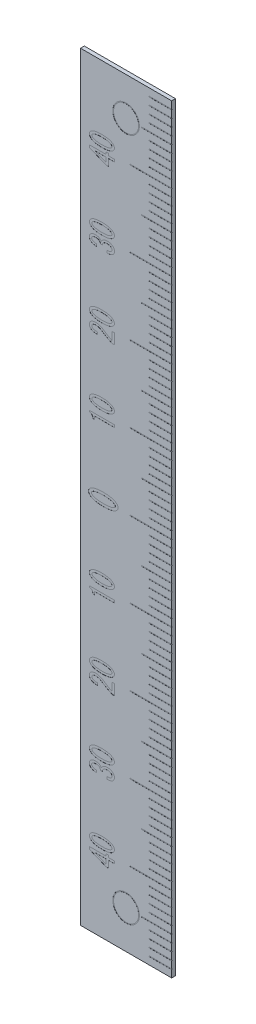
from build123d import *

# Parameters (mm, degrees)
SKETCH1_W      = 12
SKETCH1_H      = 100
EXTRUDE1_DEPTH = 0.5
SKETCH2_R      = 1.75
SKETCH2_R_2    = 1.65
EXTRUDE2_DEPTH = 0.01
EXTRUDE3_DEPTH = 0.01
SKETCH4_W      = 5.5
SKETCH4_H      = 0.1
SKETCH4_W_2    = 3
SKETCH4_W_3    = 4
EXTRUDE4_DEPTH = 0.01


with BuildPart() as part:
    # Sketch1 → Extrude1 (new body)
    with BuildSketch(Plane.XY):
        with Locations((6, 50)):
            Rectangle(SKETCH1_W, SKETCH1_H)
    extrude(amount=EXTRUDE1_DEPTH)

    # Sketch2 → Extrude2 (cut)
    # profile 1 of 2: a face of its own
    with BuildSketch(Plane.XY.offset(0.5)):
        with Locations((6, 5)):
            Circle(SKETCH2_R)
        with Locations((6, 5)):
            Circle(SKETCH2_R_2, mode=Mode.SUBTRACT)
    # profile 2 of 2: a face of its own
    with BuildSketch(Plane.XY.offset(0.5)):
        with Locations((6, 95)):
            Circle(SKETCH2_R)
        with Locations((6, 95)):
            Circle(SKETCH2_R_2, mode=Mode.SUBTRACT)
    extrude(amount=-EXTRUDE2_DEPTH, mode=Mode.SUBTRACT)

    # Sketch3 → Extrude3 (cut)
    # profile 1 of 17: a face of its own
    with BuildSketch(Plane.XY.offset(0.5)):
        Polygon((4.464202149, 89.253595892), (4.076078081, 89.253595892), (3.68481385, 89.253595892), (3.68481385, 88.358021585), (3.363889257, 88.358021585), (1.159495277, 89.263016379), (1.159495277, 89.57326442), (3.363889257, 89.57326442), (3.363889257, 89.857135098), (3.68481385, 89.857135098), (3.68481385, 89.57326442), (4.464202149, 89.57326442), align=None)
        Polygon((3.363889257, 89.253595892), (1.871684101, 89.253595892), (3.363889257, 88.655080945), align=None, mode=Mode.SUBTRACT)
    # profile 2 of 17: a face of its own
    with BuildSketch(Plane.XY.offset(0.5)):
        with BuildLine():
            add(Edge.make_bspline(
                [(2.804312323, 90.08636695), (2.763487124, 90.086598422), (2.683284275, 90.087053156), (2.565184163, 90.090916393), (2.451677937, 90.097059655), (2.342790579, 90.105920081), (2.238418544, 90.116877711), (2.138826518, 90.131643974), (2.043659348, 90.147711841), (1.953367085, 90.166540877), (1.867534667, 90.187646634), (1.786660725, 90.212475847), (1.709981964, 90.238496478), (1.63792646, 90.267351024), (1.571052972, 90.299483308), (1.508231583, 90.333293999), (1.450513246, 90.370357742), (1.414537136, 90.397244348), (1.396891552, 90.410431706)],
                knots=[0, 0, 0, 0, 1.334199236, 2.621091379, 3.861325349, 5.048806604, 6.191184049, 7.29033474, 8.338632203, 9.344988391, 10.304094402, 11.226124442, 12.10888774, 12.949942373, 13.760906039, 14.53244093, 15.280190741, 16, 16, 16, 16], degree=3))
            add(Edge.make_bspline(
                [(1.396891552, 90.410431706), (1.377886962, 90.425936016), (1.341081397, 90.455962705), (1.293642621, 90.506288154), (1.25209867, 90.556343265), (1.218531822, 90.608467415), (1.191781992, 90.661574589), (1.173561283, 90.716630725), (1.161657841, 90.77250316), (1.160214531, 90.810429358), (1.159495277, 90.829329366)],
                knots=[0, 0, 0, 0, 1.179273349, 2.283859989, 3.322502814, 4.306324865, 5.261663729, 6.17616916, 7.091118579, 8, 8, 8, 8], degree=3))
            add(Edge.make_bspline(
                [(1.159495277, 90.829329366), (1.160212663, 90.848230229), (1.161652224, 90.886158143), (1.17358392, 90.942017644), (1.191636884, 90.996945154), (1.218688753, 91.049705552), (1.252296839, 91.101723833), (1.293217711, 91.152330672), (1.341340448, 91.202029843), (1.377935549, 91.232049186), (1.396891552, 91.247598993)],
                knots=[0, 0, 0, 0, 0.909839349, 1.825753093, 2.741222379, 3.688535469, 4.673394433, 5.720979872, 6.819483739, 8, 8, 8, 8], degree=3))
            add(Edge.make_bspline(
                [(1.396891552, 91.247598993), (1.414537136, 91.260786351), (1.450513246, 91.287672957), (1.508231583, 91.3247367), (1.571052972, 91.358547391), (1.63792646, 91.390679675), (1.709981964, 91.419534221), (1.786660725, 91.445554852), (1.867534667, 91.470384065), (1.953367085, 91.491489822), (2.043659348, 91.510318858), (2.138826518, 91.526386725), (2.238418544, 91.541152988), (2.342790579, 91.552110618), (2.451677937, 91.560971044), (2.565184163, 91.567114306), (2.683284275, 91.570977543), (2.763487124, 91.571432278), (2.804312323, 91.571663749)],
                knots=[0, 0, 0, 0, 0.719809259, 1.46755907, 2.239093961, 3.050057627, 3.89111226, 4.773875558, 5.695905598, 6.655011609, 7.661367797, 8.70966526, 9.808815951, 10.951193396, 12.138674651, 13.378908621, 14.665800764, 16, 16, 16, 16], degree=3))
            add(Edge.make_bspline(
                [(2.804312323, 91.571663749), (2.845974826, 91.571432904), (2.927642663, 91.570980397), (3.047627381, 91.567132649), (3.162805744, 91.560946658), (3.273365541, 91.552091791), (3.379218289, 91.541255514), (3.480042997, 91.52631378), (3.576267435, 91.510328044), (3.667806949, 91.49146689), (3.75471717, 91.470480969), (3.836402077, 91.445542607), (3.913707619, 91.419531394), (3.986394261, 91.390685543), (4.053875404, 91.358519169), (4.117234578, 91.324907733), (4.175058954, 91.28765614), (4.211041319, 91.260780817), (4.228689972, 91.247598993)],
                knots=[0, 0, 0, 0, 1.346341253, 2.639130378, 3.8790076, 5.073442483, 6.223226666, 7.316783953, 8.366697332, 9.375051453, 10.336565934, 11.254764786, 12.134057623, 12.971986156, 13.779994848, 14.548849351, 15.288238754, 16, 16, 16, 16], degree=3))
            add(Edge.make_bspline(
                [(4.228689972, 91.247598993), (4.247351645, 91.231964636), (4.283604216, 91.201592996), (4.332476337, 91.152791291), (4.372490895, 91.101447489), (4.406527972, 91.049937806), (4.432289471, 90.996615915), (4.451811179, 90.942259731), (4.462410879, 90.886054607), (4.464024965, 90.848209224), (4.464830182, 90.829329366)],
                knots=[0, 0, 0, 0, 1.1743338, 2.28128622, 3.323893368, 4.309986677, 5.254013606, 6.173907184, 7.08902033, 8, 8, 8, 8], degree=3))
            add(Edge.make_bspline(
                [(4.464830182, 90.829329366), (4.464023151, 90.81045032), (4.462405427, 90.772606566), (4.45183315, 90.716389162), (4.432141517, 90.661902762), (4.406685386, 90.608236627), (4.372691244, 90.556620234), (4.332051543, 90.505827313), (4.283860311, 90.456400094), (4.247399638, 90.426020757), (4.228689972, 90.410431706)],
                knots=[0, 0, 0, 0, 0.910025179, 1.824179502, 2.743109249, 3.69522398, 4.680284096, 5.713901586, 6.826896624, 8, 8, 8, 8], degree=3))
            add(Edge.make_bspline(
                [(4.228689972, 90.410431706), (4.211041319, 90.397249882), (4.175058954, 90.370374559), (4.117234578, 90.333122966), (4.053875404, 90.29951153), (3.986394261, 90.267345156), (3.913707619, 90.238499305), (3.836402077, 90.212488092), (3.75471717, 90.18754973), (3.667806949, 90.166563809), (3.576267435, 90.147702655), (3.480042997, 90.131716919), (3.379218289, 90.116775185), (3.273365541, 90.105938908), (3.162805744, 90.097084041), (3.047627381, 90.09089805), (2.927642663, 90.087050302), (2.845974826, 90.086597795), (2.804312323, 90.08636695)],
                knots=[0, 0, 0, 0, 0.711761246, 1.451150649, 2.220005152, 3.028013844, 3.865942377, 4.745235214, 5.663434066, 6.624948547, 7.633302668, 8.683216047, 9.776773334, 10.926557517, 12.1209924, 13.360869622, 14.653658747, 16, 16, 16, 16], degree=3))
        make_face()
        with BuildLine():
            add(Edge.make_bspline(
                [(2.804312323, 91.261415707), (2.767676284, 91.261069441), (2.695861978, 91.260390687), (2.590316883, 91.258165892), (2.489150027, 91.253278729), (2.392481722, 91.245290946), (2.30022693, 91.237179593), (2.212814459, 91.225295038), (2.129718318, 91.213328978), (2.051258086, 91.197943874), (1.97692929, 91.181420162), (1.907398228, 91.16150603), (1.841873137, 91.141413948), (1.781453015, 91.117852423), (1.725379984, 91.092883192), (1.673815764, 91.065786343), (1.626168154, 91.037204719), (1.597468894, 91.015283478), (1.583417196, 91.004550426)],
                knots=[0, 0, 0, 0, 1.387476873, 2.71974516, 3.997715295, 5.222316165, 6.392993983, 7.5041764, 8.562605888, 9.571696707, 10.531368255, 11.445041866, 12.310057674, 13.125709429, 13.899281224, 14.633331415, 15.330853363, 16, 16, 16, 16], degree=3))
            add(Edge.make_bspline(
                [(1.583417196, 91.004550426), (1.567942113, 90.991309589), (1.538992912, 90.966539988), (1.506840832, 90.922559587), (1.485224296, 90.87705391), (1.482844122, 90.845041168), (1.481675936, 90.829329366)],
                knots=[0, 0, 0, 0, 1.162721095, 2.175099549, 3.10434177, 4, 4, 4, 4], degree=3))
            add(Edge.make_bspline(
                [(1.481675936, 90.829329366), (1.482836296, 90.813611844), (1.485200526, 90.781587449), (1.507018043, 90.736019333), (1.538753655, 90.691521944), (1.567903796, 90.666693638), (1.583417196, 90.653480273)],
                knots=[0, 0, 0, 0, 0.893494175, 1.820491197, 2.840088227, 4, 4, 4, 4], degree=3))
            add(Edge.make_bspline(
                [(1.583417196, 90.653480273), (1.598156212, 90.643035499), (1.628454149, 90.621564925), (1.677291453, 90.592299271), (1.730299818, 90.565060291), (1.787887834, 90.540907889), (1.849363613, 90.517529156), (1.915145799, 90.496237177), (1.985227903, 90.477516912), (2.059390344, 90.460570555), (2.137959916, 90.445608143), (2.220652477, 90.432335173), (2.307623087, 90.421817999), (2.398748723, 90.413272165), (2.494176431, 90.405404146), (2.593874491, 90.400498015), (2.697746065, 90.398267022), (2.768304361, 90.397589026), (2.804312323, 90.397243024)],
                knots=[0, 0, 0, 0, 0.684573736, 1.407229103, 2.156074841, 2.941731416, 3.772993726, 4.648817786, 5.561264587, 6.521855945, 7.531913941, 8.592575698, 9.69595549, 10.851956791, 12.06190895, 13.325252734, 14.634998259, 16, 16, 16, 16], degree=3))
            add(Edge.make_bspline(
                [(2.804312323, 90.397243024), (2.841785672, 90.397588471), (2.915065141, 90.398263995), (3.022703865, 90.400490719), (3.125541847, 90.405385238), (3.223691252, 90.413273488), (3.317323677, 90.421841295), (3.406404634, 90.432229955), (3.490753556, 90.445635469), (3.570391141, 90.460491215), (3.645369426, 90.477539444), (3.715901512, 90.496147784), (3.781702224, 90.517419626), (3.842729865, 90.540898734), (3.899661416, 90.565104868), (3.951853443, 90.591966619), (3.99904188, 90.621590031), (4.028053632, 90.643045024), (4.042164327, 90.653480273)],
                knots=[0, 0, 0, 0, 1.401046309, 2.739758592, 4.0248449, 5.249399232, 6.420696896, 7.540008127, 8.601571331, 9.613140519, 10.568176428, 11.475655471, 12.339456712, 13.151990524, 13.919674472, 14.651282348, 15.344012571, 16, 16, 16, 16], degree=3))
            add(Edge.make_bspline(
                [(4.042164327, 90.653480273), (4.057596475, 90.666746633), (4.086687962, 90.691755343), (4.119429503, 90.735654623), (4.140196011, 90.781762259), (4.142682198, 90.813642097), (4.143905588, 90.829329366)],
                knots=[0, 0, 0, 0, 1.159232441, 2.18529495, 3.107029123, 4, 4, 4, 4], degree=3))
            add(Edge.make_bspline(
                [(4.143905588, 90.829329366), (4.142674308, 90.845010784), (4.140172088, 90.876878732), (4.119603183, 90.922925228), (4.086449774, 90.966304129), (4.057558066, 90.991255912), (4.042164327, 91.004550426)],
                knots=[0, 0, 0, 0, 0.89511734, 1.819067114, 2.837981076, 4, 4, 4, 4], degree=3))
            add(Edge.make_bspline(
                [(4.042164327, 91.004550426), (4.028109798, 91.015278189), (3.999404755, 91.037188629), (3.95164342, 91.065951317), (3.899548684, 91.092855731), (3.842868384, 91.117856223), (3.781814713, 91.14140776), (3.715668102, 91.161504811), (3.64550559, 91.181409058), (3.570358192, 91.198018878), (3.490830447, 91.213306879), (3.406283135, 91.225349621), (3.317389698, 91.237124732), (3.22367965, 91.245296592), (3.125545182, 91.253298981), (3.022702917, 91.258160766), (2.915065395, 91.26039668), (2.841785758, 91.261070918), (2.804312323, 91.261415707)],
                knots=[0, 0, 0, 0, 0.660466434, 1.348940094, 2.080407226, 2.851088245, 3.663465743, 4.524722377, 5.434082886, 6.388935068, 7.400309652, 8.46048529, 9.580538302, 10.751610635, 11.975929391, 13.260768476, 14.599223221, 16, 16, 16, 16], degree=3))
        make_face(mode=Mode.SUBTRACT)
    # profile 3 of 17: a face of its own
    with BuildSketch(Plane.XY.offset(0.5)):
        with BuildLine():
            add(Edge.make_bspline(
                [(3.482587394, 78.709091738), (3.512525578, 78.708287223), (3.570543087, 78.706728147), (3.654420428, 78.710760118), (3.732130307, 78.718455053), (3.803298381, 78.73168567), (3.868273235, 78.749141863), (3.927053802, 78.770782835), (3.979378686, 78.79791141), (4.010164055, 78.820091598), (4.025207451, 78.830930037)],
                knots=[0, 0, 0, 0, 1.267087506, 2.455501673, 3.55133733, 4.569646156, 5.515332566, 6.395721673, 7.21606285, 8, 8, 8, 8], degree=3))
            add(Edge.make_bspline(
                [(4.025207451, 78.830930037), (4.043506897, 78.847280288), (4.079345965, 78.8793019), (4.117183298, 78.941459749), (4.139871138, 79.011713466), (4.142530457, 79.061449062), (4.143905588, 79.087167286)],
                knots=[0, 0, 0, 0, 1.002413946, 1.963205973, 2.946775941, 4, 4, 4, 4], degree=3))
            add(Edge.make_bspline(
                [(4.143905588, 79.087167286), (4.14205895, 79.10966892), (4.138250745, 79.15607263), (4.10631016, 79.222801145), (4.057507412, 79.287350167), (4.014319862, 79.324320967), (3.991293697, 79.344032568)],
                knots=[0, 0, 0, 0, 0.87119639, 1.796613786, 2.82522778, 4, 4, 4, 4], degree=3))
            add(Edge.make_bspline(
                [(3.991293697, 79.344032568), (3.977715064, 79.35383947), (3.949615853, 79.374133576), (3.90102721, 79.398039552), (3.847048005, 79.41973801), (3.786272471, 79.436247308), (3.719328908, 79.449449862), (3.646079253, 79.458528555), (3.566417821, 79.464292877), (3.511278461, 79.464917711), (3.482587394, 79.465242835)],
                knots=[0, 0, 0, 0, 0.754595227, 1.561536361, 2.43511806, 3.377163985, 4.397951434, 5.512234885, 6.705522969, 8, 8, 8, 8], degree=3))
            add(Edge.make_bspline(
                [(3.482587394, 79.465242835), (3.460377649, 79.46473344), (3.416687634, 79.463731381), (3.35267071, 79.456647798), (3.291236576, 79.44559945), (3.232735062, 79.428991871), (3.176430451, 79.40846888), (3.123062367, 79.382368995), (3.071883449, 79.352579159), (3.040443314, 79.328863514), (3.024751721, 79.317027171)],
                knots=[0, 0, 0, 0, 1.086352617, 2.137024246, 3.147391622, 4.136355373, 5.10847195, 6.074961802, 7.039224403, 8, 8, 8, 8], degree=3))
            add(Edge.make_bspline(
                [(3.024751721, 79.317027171), (3.014022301, 79.307663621), (2.992758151, 79.289106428), (2.965670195, 79.256771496), (2.94319759, 79.221167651), (2.926529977, 79.181802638), (2.913593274, 79.139332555), (2.906578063, 79.093273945), (2.903067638, 79.044064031), (2.905038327, 79.010337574), (2.906053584, 78.992962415)],
                knots=[0, 0, 0, 0, 0.947861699, 1.87852391, 2.799832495, 3.743268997, 4.71875736, 5.750864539, 6.841292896, 8, 8, 8, 8], degree=3))
            Line((2.906053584, 78.992962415), (2.617786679, 78.992962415))
            add(Edge.make_bspline(
                [(2.617786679, 78.992962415), (2.615917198, 79.01036469), (2.61227151, 79.044300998), (2.603170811, 79.09366086), (2.589082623, 79.139312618), (2.572365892, 79.182135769), (2.550836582, 79.220887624), (2.526138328, 79.256550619), (2.497813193, 79.288974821), (2.476089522, 79.307646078), (2.465174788, 79.317027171)],
                knots=[0, 0, 0, 0, 1.139052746, 2.221275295, 3.260086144, 4.244297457, 5.207730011, 6.137529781, 7.064229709, 8, 8, 8, 8], degree=3))
            add(Edge.make_bspline(
                [(2.465174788, 79.317027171), (2.453430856, 79.325692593), (2.429384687, 79.343435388), (2.388683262, 79.365118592), (2.344024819, 79.38418922), (2.294826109, 79.398815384), (2.241812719, 79.411043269), (2.184417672, 79.41879032), (2.12278159, 79.423939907), (2.080202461, 79.42467109), (2.058209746, 79.425048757)],
                knots=[0, 0, 0, 0, 0.816014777, 1.670822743, 2.574059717, 3.530392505, 4.539613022, 5.616822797, 6.769055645, 8, 8, 8, 8], degree=3))
            add(Edge.make_bspline(
                [(2.058209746, 79.425048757), (2.030985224, 79.424710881), (1.978357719, 79.424057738), (1.902231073, 79.418395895), (1.831762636, 79.409047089), (1.766898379, 79.396390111), (1.708285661, 79.3784051), (1.654956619, 79.358063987), (1.60766056, 79.33316966), (1.579858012, 79.312952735), (1.56646032, 79.303210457)],
                knots=[0, 0, 0, 0, 1.267211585, 2.44963652, 3.550842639, 4.575246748, 5.5217347, 6.401234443, 7.229575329, 8, 8, 8, 8], degree=3))
            add(Edge.make_bspline(
                [(1.56646032, 79.303210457), (1.550800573, 79.289680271), (1.520516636, 79.263514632), (1.489112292, 79.21338768), (1.467772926, 79.159180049), (1.465751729, 79.120663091), (1.464719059, 79.100984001)],
                knots=[0, 0, 0, 0, 1.053722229, 2.037763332, 2.997453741, 4, 4, 4, 4], degree=3))
            add(Edge.make_bspline(
                [(1.464719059, 79.100984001), (1.465793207, 79.081323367), (1.467906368, 79.0426452), (1.488749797, 78.988170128), (1.520925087, 78.938367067), (1.550860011, 78.911914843), (1.56646032, 78.898129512)],
                knots=[0, 0, 0, 0, 1.000412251, 1.968100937, 2.94109465, 4, 4, 4, 4], degree=3))
            add(Edge.make_bspline(
                [(1.56646032, 78.898129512), (1.581277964, 78.887055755), (1.611428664, 78.864523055), (1.662612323, 78.837488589), (1.718046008, 78.812216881), (1.779698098, 78.793150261), (1.845928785, 78.775455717), (1.917710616, 78.763754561), (1.994531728, 78.75366975), (2.047707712, 78.75119286), (2.075166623, 78.749913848)],
                knots=[0, 0, 0, 0, 0.823448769, 1.675540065, 2.573857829, 3.535986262, 4.547798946, 5.627975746, 6.775138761, 8, 8, 8, 8], degree=3))
            Line((2.075166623, 78.749913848), (2.075166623, 78.452854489))
            add(Edge.make_bspline(
                [(2.075166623, 78.452854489), (2.039320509, 78.454383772), (1.969081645, 78.457380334), (1.86662153, 78.471341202), (1.769148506, 78.489228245), (1.677509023, 78.515831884), (1.590488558, 78.54647123), (1.509243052, 78.585395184), (1.432662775, 78.629471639), (1.386090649, 78.664635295), (1.362977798, 78.682086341)],
                knots=[0, 0, 0, 0, 1.130465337, 2.215096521, 3.257023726, 4.251490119, 5.220175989, 6.161913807, 7.087793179, 8, 8, 8, 8], degree=3))
            add(Edge.make_bspline(
                [(1.362977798, 78.682086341), (1.3467956, 78.695809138), (1.31513049, 78.722661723), (1.272968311, 78.767477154), (1.238724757, 78.816404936), (1.209237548, 78.867139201), (1.18725208, 78.92158891), (1.170766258, 78.978543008), (1.161240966, 79.038909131), (1.160084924, 79.080016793), (1.159495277, 79.100984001)],
                knots=[0, 0, 0, 0, 1.054146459, 2.062739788, 3.04727221, 4.0164563, 4.972878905, 5.957576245, 6.958249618, 8, 8, 8, 8], degree=3))
            add(Edge.make_bspline(
                [(1.159495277, 79.100984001), (1.160084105, 79.122995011), (1.161233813, 79.165972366), (1.17065538, 79.228867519), (1.187412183, 79.288028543), (1.208926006, 79.344536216), (1.238532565, 79.396768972), (1.273183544, 79.446397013), (1.314699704, 79.492477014), (1.346729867, 79.519408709), (1.362977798, 79.533070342)],
                knots=[0, 0, 0, 0, 1.066551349, 2.082482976, 3.072030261, 4.042353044, 5.005167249, 5.973525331, 6.972030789, 8, 8, 8, 8], degree=3))
            add(Edge.make_bspline(
                [(1.362977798, 79.533070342), (1.383180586, 79.548391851), (1.423800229, 79.579197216), (1.49101211, 79.617407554), (1.563031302, 79.649133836), (1.639054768, 79.676462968), (1.720201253, 79.697274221), (1.806188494, 79.711237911), (1.896823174, 79.720285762), (1.958748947, 79.721491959), (1.990382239, 79.722108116)],
                knots=[0, 0, 0, 0, 0.910342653, 1.830331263, 2.769796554, 3.735781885, 4.730142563, 5.775142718, 6.863485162, 8, 8, 8, 8], degree=3))
            add(Edge.make_bspline(
                [(1.990382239, 79.722108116), (2.019286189, 79.72161156), (2.075295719, 79.720649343), (2.156472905, 79.713669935), (2.232474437, 79.70249683), (2.303229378, 79.686672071), (2.368446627, 79.664650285), (2.428974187, 79.640082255), (2.484286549, 79.610093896), (2.516949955, 79.585400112), (2.533002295, 79.57326442)],
                knots=[0, 0, 0, 0, 1.210143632, 2.344993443, 3.40861805, 4.424997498, 5.37575867, 6.287368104, 7.158331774, 8, 8, 8, 8], degree=3))
            add(Edge.make_bspline(
                [(2.533002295, 79.57326442), (2.559175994, 79.551536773), (2.608490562, 79.51059913), (2.671793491, 79.445781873), (2.721317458, 79.38266922), (2.743208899, 79.337936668), (2.753441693, 79.317027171)],
                knots=[0, 0, 0, 0, 1.195517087, 2.252505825, 3.183162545, 4, 4, 4, 4], degree=3))
            add(Edge.make_bspline(
                [(2.753441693, 79.317027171), (2.765088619, 79.34500906), (2.787538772, 79.398945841), (2.831763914, 79.47199791), (2.881380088, 79.535717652), (2.920772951, 79.570253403), (2.939967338, 79.587081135)],
                knots=[0, 0, 0, 0, 1.094399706, 2.109521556, 3.078854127, 4, 4, 4, 4], degree=3))
            add(Edge.make_bspline(
                [(2.939967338, 79.587081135), (2.959994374, 79.60234586), (2.999821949, 79.632702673), (3.064355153, 79.670989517), (3.132227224, 79.703077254), (3.202874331, 79.730156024), (3.276856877, 79.751027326), (3.354027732, 79.765256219), (3.434226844, 79.774233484), (3.488843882, 79.775485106), (3.516501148, 79.776118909)],
                knots=[0, 0, 0, 0, 0.976244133, 1.941447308, 2.904084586, 3.885987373, 4.873249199, 5.881498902, 6.927222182, 8, 8, 8, 8], degree=3))
            add(Edge.make_bspline(
                [(3.516501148, 79.776118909), (3.552324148, 79.77559206), (3.622443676, 79.774560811), (3.725084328, 79.764261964), (3.822576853, 79.747624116), (3.914506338, 79.72361205), (4.001245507, 79.69357359), (4.082537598, 79.656250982), (4.159144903, 79.612707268), (4.205595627, 79.577553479), (4.228689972, 79.560075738)],
                knots=[0, 0, 0, 0, 1.13285732, 2.217441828, 3.259318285, 4.258350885, 5.219645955, 6.158999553, 7.084692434, 8, 8, 8, 8], degree=3))
            add(Edge.make_bspline(
                [(4.228689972, 79.560075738), (4.247408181, 79.544073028), (4.284031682, 79.512762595), (4.332853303, 79.461250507), (4.373280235, 79.40591535), (4.406871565, 79.348128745), (4.432721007, 79.287091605), (4.451971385, 79.223397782), (4.462541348, 79.156184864), (4.464058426, 79.110438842), (4.464830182, 79.087167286)],
                knots=[0, 0, 0, 0, 1.078182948, 2.109541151, 3.099814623, 4.073306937, 5.030426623, 5.996463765, 6.980776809, 8, 8, 8, 8], degree=3))
            add(Edge.make_bspline(
                [(4.464830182, 79.087167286), (4.464367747, 79.062001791), (4.463461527, 79.012685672), (4.452274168, 78.941195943), (4.435512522, 78.873719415), (4.411441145, 78.810497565), (4.38066456, 78.751121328), (4.342591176, 78.696168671), (4.297876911, 78.645289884), (4.263207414, 78.615937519), (4.245646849, 78.601070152)],
                knots=[0, 0, 0, 0, 1.091653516, 2.139282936, 3.133504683, 4.105839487, 5.069340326, 6.029921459, 7.002128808, 8, 8, 8, 8], degree=3))
            add(Edge.make_bspline(
                [(4.245646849, 78.601070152), (4.223356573, 78.584883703), (4.177849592, 78.551838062), (4.101818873, 78.510403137), (4.01783525, 78.476087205), (3.926096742, 78.448030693), (3.826687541, 78.425207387), (3.71890008, 78.410072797), (3.603344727, 78.400491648), (3.523639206, 78.399403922), (3.482587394, 78.398843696)],
                knots=[0, 0, 0, 0, 0.821972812, 1.678108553, 2.577822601, 3.526913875, 4.539938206, 5.620279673, 6.774340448, 8, 8, 8, 8], degree=3))
            Line((3.482587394, 78.398843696), (3.482587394, 78.709091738))
        make_face()
    # profile 4 of 17: a face of its own
    with BuildSketch(Plane.XY.offset(0.5)):
        with BuildLine():
            add(Edge.make_bspline(
                [(2.804312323, 80.08636695), (2.763487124, 80.086598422), (2.683284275, 80.087053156), (2.565184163, 80.090916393), (2.451677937, 80.097059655), (2.342790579, 80.105920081), (2.238418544, 80.116877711), (2.138826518, 80.131643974), (2.043659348, 80.147711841), (1.953367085, 80.166540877), (1.867534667, 80.187646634), (1.786660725, 80.212475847), (1.709981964, 80.238496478), (1.63792646, 80.267351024), (1.571052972, 80.299483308), (1.508231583, 80.333293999), (1.450513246, 80.370357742), (1.414537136, 80.397244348), (1.396891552, 80.410431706)],
                knots=[0, 0, 0, 0, 1.334199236, 2.621091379, 3.861325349, 5.048806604, 6.191184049, 7.29033474, 8.338632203, 9.344988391, 10.304094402, 11.226124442, 12.10888774, 12.949942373, 13.760906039, 14.53244093, 15.280190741, 16, 16, 16, 16], degree=3))
            add(Edge.make_bspline(
                [(1.396891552, 80.410431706), (1.377886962, 80.425936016), (1.341081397, 80.455962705), (1.293642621, 80.506288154), (1.25209867, 80.556343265), (1.218531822, 80.608467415), (1.191781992, 80.661574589), (1.173561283, 80.716630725), (1.161657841, 80.77250316), (1.160214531, 80.810429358), (1.159495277, 80.829329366)],
                knots=[0, 0, 0, 0, 1.179273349, 2.283859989, 3.322502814, 4.306324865, 5.261663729, 6.17616916, 7.091118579, 8, 8, 8, 8], degree=3))
            add(Edge.make_bspline(
                [(1.159495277, 80.829329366), (1.160212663, 80.848230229), (1.161652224, 80.886158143), (1.17358392, 80.942017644), (1.191636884, 80.996945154), (1.218688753, 81.049705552), (1.252296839, 81.101723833), (1.293217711, 81.152330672), (1.341340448, 81.202029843), (1.377935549, 81.232049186), (1.396891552, 81.247598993)],
                knots=[0, 0, 0, 0, 0.909839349, 1.825753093, 2.741222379, 3.688535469, 4.673394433, 5.720979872, 6.819483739, 8, 8, 8, 8], degree=3))
            add(Edge.make_bspline(
                [(1.396891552, 81.247598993), (1.414537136, 81.260786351), (1.450513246, 81.287672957), (1.508231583, 81.3247367), (1.571052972, 81.358547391), (1.63792646, 81.390679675), (1.709981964, 81.419534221), (1.786660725, 81.445554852), (1.867534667, 81.470384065), (1.953367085, 81.491489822), (2.043659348, 81.510318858), (2.138826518, 81.526386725), (2.238418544, 81.541152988), (2.342790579, 81.552110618), (2.451677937, 81.560971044), (2.565184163, 81.567114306), (2.683284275, 81.570977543), (2.763487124, 81.571432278), (2.804312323, 81.571663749)],
                knots=[0, 0, 0, 0, 0.719809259, 1.46755907, 2.239093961, 3.050057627, 3.89111226, 4.773875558, 5.695905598, 6.655011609, 7.661367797, 8.70966526, 9.808815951, 10.951193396, 12.138674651, 13.378908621, 14.665800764, 16, 16, 16, 16], degree=3))
            add(Edge.make_bspline(
                [(2.804312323, 81.571663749), (2.845974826, 81.571432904), (2.927642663, 81.570980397), (3.047627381, 81.567132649), (3.162805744, 81.560946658), (3.273365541, 81.552091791), (3.379218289, 81.541255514), (3.480042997, 81.52631378), (3.576267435, 81.510328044), (3.667806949, 81.49146689), (3.75471717, 81.470480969), (3.836402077, 81.445542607), (3.913707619, 81.419531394), (3.986394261, 81.390685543), (4.053875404, 81.358519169), (4.117234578, 81.324907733), (4.175058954, 81.28765614), (4.211041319, 81.260780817), (4.228689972, 81.247598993)],
                knots=[0, 0, 0, 0, 1.346341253, 2.639130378, 3.8790076, 5.073442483, 6.223226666, 7.316783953, 8.366697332, 9.375051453, 10.336565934, 11.254764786, 12.134057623, 12.971986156, 13.779994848, 14.548849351, 15.288238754, 16, 16, 16, 16], degree=3))
            add(Edge.make_bspline(
                [(4.228689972, 81.247598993), (4.247351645, 81.231964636), (4.283604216, 81.201592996), (4.332476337, 81.152791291), (4.372490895, 81.101447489), (4.406527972, 81.049937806), (4.432289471, 80.996615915), (4.451811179, 80.942259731), (4.462410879, 80.886054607), (4.464024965, 80.848209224), (4.464830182, 80.829329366)],
                knots=[0, 0, 0, 0, 1.1743338, 2.28128622, 3.323893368, 4.309986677, 5.254013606, 6.173907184, 7.08902033, 8, 8, 8, 8], degree=3))
            add(Edge.make_bspline(
                [(4.464830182, 80.829329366), (4.464023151, 80.81045032), (4.462405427, 80.772606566), (4.45183315, 80.716389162), (4.432141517, 80.661902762), (4.406685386, 80.608236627), (4.372691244, 80.556620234), (4.332051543, 80.505827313), (4.283860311, 80.456400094), (4.247399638, 80.426020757), (4.228689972, 80.410431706)],
                knots=[0, 0, 0, 0, 0.910025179, 1.824179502, 2.743109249, 3.69522398, 4.680284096, 5.713901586, 6.826896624, 8, 8, 8, 8], degree=3))
            add(Edge.make_bspline(
                [(4.228689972, 80.410431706), (4.211041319, 80.397249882), (4.175058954, 80.370374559), (4.117234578, 80.333122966), (4.053875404, 80.29951153), (3.986394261, 80.267345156), (3.913707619, 80.238499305), (3.836402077, 80.212488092), (3.75471717, 80.18754973), (3.667806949, 80.166563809), (3.576267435, 80.147702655), (3.480042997, 80.131716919), (3.379218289, 80.116775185), (3.273365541, 80.105938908), (3.162805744, 80.097084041), (3.047627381, 80.09089805), (2.927642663, 80.087050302), (2.845974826, 80.086597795), (2.804312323, 80.08636695)],
                knots=[0, 0, 0, 0, 0.711761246, 1.451150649, 2.220005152, 3.028013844, 3.865942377, 4.745235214, 5.663434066, 6.624948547, 7.633302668, 8.683216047, 9.776773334, 10.926557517, 12.1209924, 13.360869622, 14.653658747, 16, 16, 16, 16], degree=3))
        make_face()
        with BuildLine():
            add(Edge.make_bspline(
                [(2.804312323, 81.261415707), (2.767676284, 81.261069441), (2.695861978, 81.260390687), (2.590316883, 81.258165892), (2.489150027, 81.253278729), (2.392481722, 81.245290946), (2.30022693, 81.237179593), (2.212814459, 81.225295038), (2.129718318, 81.213328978), (2.051258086, 81.197943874), (1.97692929, 81.181420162), (1.907398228, 81.16150603), (1.841873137, 81.141413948), (1.781453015, 81.117852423), (1.725379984, 81.092883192), (1.673815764, 81.065786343), (1.626168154, 81.037204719), (1.597468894, 81.015283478), (1.583417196, 81.004550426)],
                knots=[0, 0, 0, 0, 1.387476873, 2.71974516, 3.997715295, 5.222316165, 6.392993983, 7.5041764, 8.562605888, 9.571696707, 10.531368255, 11.445041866, 12.310057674, 13.125709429, 13.899281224, 14.633331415, 15.330853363, 16, 16, 16, 16], degree=3))
            add(Edge.make_bspline(
                [(1.583417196, 81.004550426), (1.567942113, 80.991309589), (1.538992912, 80.966539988), (1.506840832, 80.922559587), (1.485224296, 80.87705391), (1.482844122, 80.845041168), (1.481675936, 80.829329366)],
                knots=[0, 0, 0, 0, 1.162721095, 2.175099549, 3.10434177, 4, 4, 4, 4], degree=3))
            add(Edge.make_bspline(
                [(1.481675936, 80.829329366), (1.482836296, 80.813611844), (1.485200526, 80.781587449), (1.507018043, 80.736019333), (1.538753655, 80.691521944), (1.567903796, 80.666693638), (1.583417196, 80.653480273)],
                knots=[0, 0, 0, 0, 0.893494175, 1.820491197, 2.840088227, 4, 4, 4, 4], degree=3))
            add(Edge.make_bspline(
                [(1.583417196, 80.653480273), (1.598156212, 80.643035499), (1.628454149, 80.621564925), (1.677291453, 80.592299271), (1.730299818, 80.565060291), (1.787887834, 80.540907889), (1.849363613, 80.517529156), (1.915145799, 80.496237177), (1.985227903, 80.477516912), (2.059390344, 80.460570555), (2.137959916, 80.445608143), (2.220652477, 80.432335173), (2.307623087, 80.421817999), (2.398748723, 80.413272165), (2.494176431, 80.405404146), (2.593874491, 80.400498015), (2.697746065, 80.398267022), (2.768304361, 80.397589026), (2.804312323, 80.397243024)],
                knots=[0, 0, 0, 0, 0.684573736, 1.407229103, 2.156074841, 2.941731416, 3.772993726, 4.648817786, 5.561264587, 6.521855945, 7.531913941, 8.592575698, 9.69595549, 10.851956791, 12.06190895, 13.325252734, 14.634998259, 16, 16, 16, 16], degree=3))
            add(Edge.make_bspline(
                [(2.804312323, 80.397243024), (2.841785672, 80.397588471), (2.915065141, 80.398263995), (3.022703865, 80.400490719), (3.125541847, 80.405385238), (3.223691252, 80.413273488), (3.317323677, 80.421841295), (3.406404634, 80.432229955), (3.490753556, 80.445635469), (3.570391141, 80.460491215), (3.645369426, 80.477539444), (3.715901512, 80.496147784), (3.781702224, 80.517419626), (3.842729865, 80.540898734), (3.899661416, 80.565104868), (3.951853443, 80.591966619), (3.99904188, 80.621590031), (4.028053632, 80.643045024), (4.042164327, 80.653480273)],
                knots=[0, 0, 0, 0, 1.401046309, 2.739758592, 4.0248449, 5.249399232, 6.420696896, 7.540008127, 8.601571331, 9.613140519, 10.568176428, 11.475655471, 12.339456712, 13.151990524, 13.919674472, 14.651282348, 15.344012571, 16, 16, 16, 16], degree=3))
            add(Edge.make_bspline(
                [(4.042164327, 80.653480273), (4.057596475, 80.666746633), (4.086687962, 80.691755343), (4.119429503, 80.735654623), (4.140196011, 80.781762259), (4.142682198, 80.813642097), (4.143905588, 80.829329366)],
                knots=[0, 0, 0, 0, 1.159232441, 2.18529495, 3.107029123, 4, 4, 4, 4], degree=3))
            add(Edge.make_bspline(
                [(4.143905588, 80.829329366), (4.142674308, 80.845010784), (4.140172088, 80.876878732), (4.119603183, 80.922925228), (4.086449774, 80.966304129), (4.057558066, 80.991255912), (4.042164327, 81.004550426)],
                knots=[0, 0, 0, 0, 0.89511734, 1.819067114, 2.837981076, 4, 4, 4, 4], degree=3))
            add(Edge.make_bspline(
                [(4.042164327, 81.004550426), (4.028109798, 81.015278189), (3.999404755, 81.037188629), (3.95164342, 81.065951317), (3.899548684, 81.092855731), (3.842868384, 81.117856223), (3.781814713, 81.14140776), (3.715668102, 81.161504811), (3.64550559, 81.181409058), (3.570358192, 81.198018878), (3.490830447, 81.213306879), (3.406283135, 81.225349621), (3.317389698, 81.237124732), (3.22367965, 81.245296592), (3.125545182, 81.253298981), (3.022702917, 81.258160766), (2.915065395, 81.26039668), (2.841785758, 81.261070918), (2.804312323, 81.261415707)],
                knots=[0, 0, 0, 0, 0.660466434, 1.348940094, 2.080407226, 2.851088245, 3.663465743, 4.524722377, 5.434082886, 6.388935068, 7.400309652, 8.46048529, 9.580538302, 10.751610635, 11.975929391, 13.260768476, 14.599223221, 16, 16, 16, 16], degree=3))
        make_face(mode=Mode.SUBTRACT)
    # profile 5 of 17: a face of its own
    with BuildSketch(Plane.XY.offset(0.5)):
        with BuildLine():
            Line((4.143905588, 69.789307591), (4.464830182, 69.789307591))
            Line((4.464830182, 69.789307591), (4.464830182, 68.412032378))
            Line((4.464830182, 68.412032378), (4.194776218, 68.412032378))
            add(Edge.make_bspline(
                [(4.194776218, 68.412032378), (4.134104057, 68.438239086), (4.012820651, 68.490626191), (3.833941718, 68.576059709), (3.65666089, 68.664824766), (3.482086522, 68.759401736), (3.309323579, 68.858008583), (3.138392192, 68.960822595), (2.969988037, 69.068963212), (2.859615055, 69.144268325), (2.804312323, 69.18200019)],
                knots=[0, 0, 0, 0, 0.99614483, 1.991289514, 2.987624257, 3.984438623, 4.983697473, 5.985971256, 6.990864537, 8, 8, 8, 8], degree=3))
            add(Edge.make_bspline(
                [(2.804312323, 69.18200019), (2.773407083, 69.202561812), (2.712458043, 69.24311193), (2.617211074, 69.295150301), (2.521104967, 69.339278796), (2.423672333, 69.375332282), (2.325440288, 69.4035815), (2.22593849, 69.42388529), (2.125513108, 69.436178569), (2.058034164, 69.437551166), (2.024295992, 69.438237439)],
                knots=[0, 0, 0, 0, 1.067918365, 2.106070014, 3.119789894, 4.109153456, 5.093164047, 6.058534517, 7.029304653, 8, 8, 8, 8], degree=3))
            add(Edge.make_bspline(
                [(2.024295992, 69.438237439), (2.001046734, 69.437894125), (1.955732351, 69.437224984), (1.889860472, 69.431518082), (1.828132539, 69.422267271), (1.770797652, 69.409104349), (1.71743613, 69.392320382), (1.668710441, 69.370724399), (1.623431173, 69.346637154), (1.596599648, 69.326782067), (1.583417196, 69.317027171)],
                knots=[0, 0, 0, 0, 1.197973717, 2.334932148, 3.404529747, 4.412096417, 5.3640046, 6.281988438, 7.155932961, 8, 8, 8, 8], degree=3))
            add(Edge.make_bspline(
                [(1.583417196, 69.317027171), (1.567746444, 69.303076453), (1.537248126, 69.275925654), (1.505254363, 69.223199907), (1.484772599, 69.164442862), (1.482726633, 69.122515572), (1.481675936, 69.100984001)],
                knots=[0, 0, 0, 0, 1.01321699, 1.971916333, 2.958486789, 4, 4, 4, 4], degree=3))
            add(Edge.make_bspline(
                [(1.481675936, 69.100984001), (1.483585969, 69.082717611), (1.487575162, 69.044567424), (1.51537348, 68.988943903), (1.559276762, 68.934674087), (1.597036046, 68.902326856), (1.61733095, 68.88494083)],
                knots=[0, 0, 0, 0, 0.831770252, 1.737190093, 2.783782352, 4, 4, 4, 4], degree=3))
            add(Edge.make_bspline(
                [(1.61733095, 68.88494083), (1.63152823, 68.875101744), (1.661915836, 68.854042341), (1.715884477, 68.829594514), (1.77953563, 68.808918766), (1.853234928, 68.792609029), (1.936819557, 68.778578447), (2.030630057, 68.769762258), (2.13433812, 68.764032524), (2.206835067, 68.763421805), (2.24473539, 68.76310253)],
                knots=[0, 0, 0, 0, 0.638255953, 1.36611168, 2.182006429, 3.11234378, 4.156826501, 5.317109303, 6.597424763, 8, 8, 8, 8], degree=3))
            Line((2.24473539, 68.76310253), (2.24473539, 68.466043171))
            add(Edge.make_bspline(
                [(2.24473539, 68.466043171), (2.195515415, 68.46790543), (2.100702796, 68.471492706), (1.963728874, 68.483794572), (1.837426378, 68.503038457), (1.721668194, 68.528812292), (1.616016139, 68.559516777), (1.521404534, 68.598268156), (1.436291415, 68.64179784), (1.386844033, 68.67828985), (1.362977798, 68.695903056)],
                knots=[0, 0, 0, 0, 1.276449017, 2.458828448, 3.562299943, 4.585123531, 5.530965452, 6.409552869, 7.23235602, 8, 8, 8, 8], degree=3))
            add(Edge.make_bspline(
                [(1.362977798, 68.695903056), (1.346729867, 68.709564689), (1.314699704, 68.736496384), (1.273183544, 68.782576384), (1.238532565, 68.832204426), (1.208926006, 68.884437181), (1.187412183, 68.940944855), (1.17065538, 69.000105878), (1.161233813, 69.063001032), (1.160084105, 69.105978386), (1.159495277, 69.127989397)],
                knots=[0, 0, 0, 0, 1.027969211, 2.026474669, 2.994832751, 3.957646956, 4.927969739, 5.917517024, 6.933448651, 8, 8, 8, 8], degree=3))
            add(Edge.make_bspline(
                [(1.159495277, 69.127989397), (1.159956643, 69.148979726), (1.160867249, 69.190408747), (1.172379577, 69.250967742), (1.188861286, 69.309450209), (1.21397118, 69.364787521), (1.24481477, 69.418042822), (1.282906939, 69.468678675), (1.328294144, 69.516390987), (1.362484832, 69.545314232), (1.379934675, 69.560075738)],
                knots=[0, 0, 0, 0, 1.000230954, 1.974175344, 2.932001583, 3.893571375, 4.865053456, 5.864036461, 6.909871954, 8, 8, 8, 8], degree=3))
            add(Edge.make_bspline(
                [(1.379934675, 69.560075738), (1.400321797, 69.575446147), (1.441611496, 69.606575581), (1.510569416, 69.644342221), (1.584899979, 69.676515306), (1.664800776, 69.703727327), (1.75083857, 69.724143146), (1.84261768, 69.738396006), (1.93996472, 69.747294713), (2.006900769, 69.748496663), (2.041252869, 69.749113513)],
                knots=[0, 0, 0, 0, 0.873404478, 1.768891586, 2.683909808, 3.645167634, 4.655436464, 5.707963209, 6.823708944, 8, 8, 8, 8], degree=3))
            add(Edge.make_bspline(
                [(2.041252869, 69.749113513), (2.0825466, 69.747997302), (2.165684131, 69.745750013), (2.2908176, 69.728176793), (2.416613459, 69.69873904), (2.543909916, 69.659401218), (2.671696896, 69.607206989), (2.800597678, 69.544064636), (2.930892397, 69.470149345), (3.015481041, 69.41326659), (3.058665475, 69.384226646)],
                knots=[0, 0, 0, 0, 0.902713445, 1.817451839, 2.756860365, 3.725448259, 4.727634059, 5.771721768, 6.862413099, 8, 8, 8, 8], degree=3))
            add(Edge.make_bspline(
                [(3.058665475, 69.384226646), (3.150692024, 69.32107194), (3.331341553, 69.197098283), (3.605692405, 69.027797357), (3.87414261, 68.87223849), (4.055117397, 68.780905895), (4.143905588, 68.736097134)],
                knots=[0, 0, 0, 0, 1.058433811, 2.077721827, 3.056909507, 4, 4, 4, 4], degree=3))
            Line((4.143905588, 68.736097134), (4.143905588, 69.789307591))
        make_face()
    # profile 6 of 17: a face of its own
    with BuildSketch(Plane.XY.offset(0.5)):
        with BuildLine():
            add(Edge.make_bspline(
                [(2.804312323, 70.08636695), (2.763487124, 70.086598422), (2.683284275, 70.087053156), (2.565184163, 70.090916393), (2.451677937, 70.097059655), (2.342790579, 70.105920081), (2.238418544, 70.116877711), (2.138826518, 70.131643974), (2.043659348, 70.147711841), (1.953367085, 70.166540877), (1.867534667, 70.187646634), (1.786660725, 70.212475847), (1.709981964, 70.238496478), (1.63792646, 70.267351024), (1.571052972, 70.299483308), (1.508231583, 70.333293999), (1.450513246, 70.370357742), (1.414537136, 70.397244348), (1.396891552, 70.410431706)],
                knots=[0, 0, 0, 0, 1.334199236, 2.621091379, 3.861325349, 5.048806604, 6.191184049, 7.29033474, 8.338632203, 9.344988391, 10.304094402, 11.226124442, 12.10888774, 12.949942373, 13.760906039, 14.53244093, 15.280190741, 16, 16, 16, 16], degree=3))
            add(Edge.make_bspline(
                [(1.396891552, 70.410431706), (1.377886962, 70.425936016), (1.341081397, 70.455962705), (1.293642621, 70.506288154), (1.25209867, 70.556343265), (1.218531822, 70.608467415), (1.191781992, 70.661574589), (1.173561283, 70.716630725), (1.161657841, 70.77250316), (1.160214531, 70.810429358), (1.159495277, 70.829329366)],
                knots=[0, 0, 0, 0, 1.179273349, 2.283859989, 3.322502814, 4.306324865, 5.261663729, 6.17616916, 7.091118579, 8, 8, 8, 8], degree=3))
            add(Edge.make_bspline(
                [(1.159495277, 70.829329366), (1.160212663, 70.848230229), (1.161652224, 70.886158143), (1.17358392, 70.942017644), (1.191636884, 70.996945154), (1.218688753, 71.049705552), (1.252296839, 71.101723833), (1.293217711, 71.152330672), (1.341340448, 71.202029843), (1.377935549, 71.232049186), (1.396891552, 71.247598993)],
                knots=[0, 0, 0, 0, 0.909839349, 1.825753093, 2.741222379, 3.688535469, 4.673394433, 5.720979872, 6.819483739, 8, 8, 8, 8], degree=3))
            add(Edge.make_bspline(
                [(1.396891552, 71.247598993), (1.414537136, 71.260786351), (1.450513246, 71.287672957), (1.508231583, 71.3247367), (1.571052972, 71.358547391), (1.63792646, 71.390679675), (1.709981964, 71.419534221), (1.786660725, 71.445554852), (1.867534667, 71.470384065), (1.953367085, 71.491489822), (2.043659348, 71.510318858), (2.138826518, 71.526386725), (2.238418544, 71.541152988), (2.342790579, 71.552110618), (2.451677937, 71.560971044), (2.565184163, 71.567114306), (2.683284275, 71.570977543), (2.763487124, 71.571432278), (2.804312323, 71.571663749)],
                knots=[0, 0, 0, 0, 0.719809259, 1.46755907, 2.239093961, 3.050057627, 3.89111226, 4.773875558, 5.695905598, 6.655011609, 7.661367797, 8.70966526, 9.808815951, 10.951193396, 12.138674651, 13.378908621, 14.665800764, 16, 16, 16, 16], degree=3))
            add(Edge.make_bspline(
                [(2.804312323, 71.571663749), (2.845974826, 71.571432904), (2.927642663, 71.570980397), (3.047627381, 71.567132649), (3.162805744, 71.560946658), (3.273365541, 71.552091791), (3.379218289, 71.541255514), (3.480042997, 71.52631378), (3.576267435, 71.510328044), (3.667806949, 71.49146689), (3.75471717, 71.470480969), (3.836402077, 71.445542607), (3.913707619, 71.419531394), (3.986394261, 71.390685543), (4.053875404, 71.358519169), (4.117234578, 71.324907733), (4.175058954, 71.28765614), (4.211041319, 71.260780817), (4.228689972, 71.247598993)],
                knots=[0, 0, 0, 0, 1.346341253, 2.639130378, 3.8790076, 5.073442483, 6.223226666, 7.316783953, 8.366697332, 9.375051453, 10.336565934, 11.254764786, 12.134057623, 12.971986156, 13.779994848, 14.548849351, 15.288238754, 16, 16, 16, 16], degree=3))
            add(Edge.make_bspline(
                [(4.228689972, 71.247598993), (4.247351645, 71.231964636), (4.283604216, 71.201592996), (4.332476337, 71.152791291), (4.372490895, 71.101447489), (4.406527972, 71.049937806), (4.432289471, 70.996615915), (4.451811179, 70.942259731), (4.462410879, 70.886054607), (4.464024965, 70.848209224), (4.464830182, 70.829329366)],
                knots=[0, 0, 0, 0, 1.1743338, 2.28128622, 3.323893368, 4.309986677, 5.254013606, 6.173907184, 7.08902033, 8, 8, 8, 8], degree=3))
            add(Edge.make_bspline(
                [(4.464830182, 70.829329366), (4.464023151, 70.81045032), (4.462405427, 70.772606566), (4.45183315, 70.716389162), (4.432141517, 70.661902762), (4.406685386, 70.608236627), (4.372691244, 70.556620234), (4.332051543, 70.505827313), (4.283860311, 70.456400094), (4.247399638, 70.426020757), (4.228689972, 70.410431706)],
                knots=[0, 0, 0, 0, 0.910025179, 1.824179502, 2.743109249, 3.69522398, 4.680284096, 5.713901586, 6.826896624, 8, 8, 8, 8], degree=3))
            add(Edge.make_bspline(
                [(4.228689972, 70.410431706), (4.211041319, 70.397249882), (4.175058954, 70.370374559), (4.117234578, 70.333122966), (4.053875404, 70.29951153), (3.986394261, 70.267345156), (3.913707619, 70.238499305), (3.836402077, 70.212488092), (3.75471717, 70.18754973), (3.667806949, 70.166563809), (3.576267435, 70.147702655), (3.480042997, 70.131716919), (3.379218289, 70.116775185), (3.273365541, 70.105938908), (3.162805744, 70.097084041), (3.047627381, 70.09089805), (2.927642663, 70.087050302), (2.845974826, 70.086597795), (2.804312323, 70.08636695)],
                knots=[0, 0, 0, 0, 0.711761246, 1.451150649, 2.220005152, 3.028013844, 3.865942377, 4.745235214, 5.663434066, 6.624948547, 7.633302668, 8.683216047, 9.776773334, 10.926557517, 12.1209924, 13.360869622, 14.653658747, 16, 16, 16, 16], degree=3))
        make_face()
        with BuildLine():
            add(Edge.make_bspline(
                [(2.804312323, 71.261415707), (2.767676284, 71.261069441), (2.695861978, 71.260390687), (2.590316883, 71.258165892), (2.489150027, 71.253278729), (2.392481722, 71.245290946), (2.30022693, 71.237179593), (2.212814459, 71.225295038), (2.129718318, 71.213328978), (2.051258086, 71.197943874), (1.97692929, 71.181420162), (1.907398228, 71.16150603), (1.841873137, 71.141413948), (1.781453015, 71.117852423), (1.725379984, 71.092883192), (1.673815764, 71.065786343), (1.626168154, 71.037204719), (1.597468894, 71.015283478), (1.583417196, 71.004550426)],
                knots=[0, 0, 0, 0, 1.387476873, 2.71974516, 3.997715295, 5.222316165, 6.392993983, 7.5041764, 8.562605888, 9.571696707, 10.531368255, 11.445041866, 12.310057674, 13.125709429, 13.899281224, 14.633331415, 15.330853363, 16, 16, 16, 16], degree=3))
            add(Edge.make_bspline(
                [(1.583417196, 71.004550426), (1.567942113, 70.991309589), (1.538992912, 70.966539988), (1.506840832, 70.922559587), (1.485224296, 70.87705391), (1.482844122, 70.845041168), (1.481675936, 70.829329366)],
                knots=[0, 0, 0, 0, 1.162721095, 2.175099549, 3.10434177, 4, 4, 4, 4], degree=3))
            add(Edge.make_bspline(
                [(1.481675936, 70.829329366), (1.482836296, 70.813611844), (1.485200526, 70.781587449), (1.507018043, 70.736019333), (1.538753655, 70.691521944), (1.567903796, 70.666693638), (1.583417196, 70.653480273)],
                knots=[0, 0, 0, 0, 0.893494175, 1.820491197, 2.840088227, 4, 4, 4, 4], degree=3))
            add(Edge.make_bspline(
                [(1.583417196, 70.653480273), (1.598156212, 70.643035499), (1.628454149, 70.621564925), (1.677291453, 70.592299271), (1.730299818, 70.565060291), (1.787887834, 70.540907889), (1.849363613, 70.517529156), (1.915145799, 70.496237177), (1.985227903, 70.477516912), (2.059390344, 70.460570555), (2.137959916, 70.445608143), (2.220652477, 70.432335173), (2.307623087, 70.421817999), (2.398748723, 70.413272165), (2.494176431, 70.405404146), (2.593874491, 70.400498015), (2.697746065, 70.398267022), (2.768304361, 70.397589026), (2.804312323, 70.397243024)],
                knots=[0, 0, 0, 0, 0.684573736, 1.407229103, 2.156074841, 2.941731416, 3.772993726, 4.648817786, 5.561264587, 6.521855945, 7.531913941, 8.592575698, 9.69595549, 10.851956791, 12.06190895, 13.325252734, 14.634998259, 16, 16, 16, 16], degree=3))
            add(Edge.make_bspline(
                [(2.804312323, 70.397243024), (2.841785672, 70.397588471), (2.915065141, 70.398263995), (3.022703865, 70.400490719), (3.125541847, 70.405385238), (3.223691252, 70.413273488), (3.317323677, 70.421841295), (3.406404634, 70.432229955), (3.490753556, 70.445635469), (3.570391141, 70.460491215), (3.645369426, 70.477539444), (3.715901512, 70.496147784), (3.781702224, 70.517419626), (3.842729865, 70.540898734), (3.899661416, 70.565104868), (3.951853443, 70.591966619), (3.99904188, 70.621590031), (4.028053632, 70.643045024), (4.042164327, 70.653480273)],
                knots=[0, 0, 0, 0, 1.401046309, 2.739758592, 4.0248449, 5.249399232, 6.420696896, 7.540008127, 8.601571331, 9.613140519, 10.568176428, 11.475655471, 12.339456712, 13.151990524, 13.919674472, 14.651282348, 15.344012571, 16, 16, 16, 16], degree=3))
            add(Edge.make_bspline(
                [(4.042164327, 70.653480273), (4.057596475, 70.666746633), (4.086687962, 70.691755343), (4.119429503, 70.735654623), (4.140196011, 70.781762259), (4.142682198, 70.813642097), (4.143905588, 70.829329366)],
                knots=[0, 0, 0, 0, 1.159232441, 2.18529495, 3.107029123, 4, 4, 4, 4], degree=3))
            add(Edge.make_bspline(
                [(4.143905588, 70.829329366), (4.142674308, 70.845010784), (4.140172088, 70.876878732), (4.119603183, 70.922925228), (4.086449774, 70.966304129), (4.057558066, 70.991255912), (4.042164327, 71.004550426)],
                knots=[0, 0, 0, 0, 0.89511734, 1.819067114, 2.837981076, 4, 4, 4, 4], degree=3))
            add(Edge.make_bspline(
                [(4.042164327, 71.004550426), (4.028109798, 71.015278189), (3.999404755, 71.037188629), (3.95164342, 71.065951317), (3.899548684, 71.092855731), (3.842868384, 71.117856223), (3.781814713, 71.14140776), (3.715668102, 71.161504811), (3.64550559, 71.181409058), (3.570358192, 71.198018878), (3.490830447, 71.213306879), (3.406283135, 71.225349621), (3.317389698, 71.237124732), (3.22367965, 71.245296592), (3.125545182, 71.253298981), (3.022702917, 71.258160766), (2.915065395, 71.26039668), (2.841785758, 71.261070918), (2.804312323, 71.261415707)],
                knots=[0, 0, 0, 0, 0.660466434, 1.348940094, 2.080407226, 2.851088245, 3.663465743, 4.524722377, 5.434082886, 6.388935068, 7.400309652, 8.46048529, 9.580538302, 10.751610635, 11.975929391, 13.260768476, 14.599223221, 16, 16, 16, 16], degree=3))
        make_face(mode=Mode.SUBTRACT)
    # profile 7 of 17: a face of its own
    with BuildSketch(Plane.XY.offset(0.5)):
        with BuildLine():
            Line((4.464202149, 58.983541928), (3.143449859, 58.983541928))
            Line((3.143449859, 58.983541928), (1.834630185, 58.983541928))
            Line((1.834630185, 58.983541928), (1.834630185, 58.58788147))
            Line((1.834630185, 58.58788147), (1.634287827, 58.58788147))
            add(Edge.make_bspline(
                [(1.634287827, 58.58788147), (1.633949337, 58.607154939), (1.633292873, 58.644533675), (1.627537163, 58.699138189), (1.617992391, 58.750485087), (1.605914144, 58.79930573), (1.588535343, 58.844454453), (1.568559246, 58.887235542), (1.544100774, 58.926478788), (1.516032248, 58.962796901), (1.484633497, 58.996211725), (1.449221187, 59.026469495), (1.410057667, 59.053561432), (1.367120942, 59.077453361), (1.320438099, 59.09818504), (1.270182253, 59.115604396), (1.216225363, 59.130205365), (1.17880858, 59.137442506), (1.159495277, 59.141178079)],
                knots=[0, 0, 0, 0, 1.144858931, 2.220325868, 3.257124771, 4.246590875, 5.202985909, 6.126465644, 7.048017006, 7.94360395, 8.849836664, 9.767181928, 10.705616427, 11.674465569, 12.68221077, 13.736395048, 14.831602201, 16, 16, 16, 16], degree=3))
            Line((1.159495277, 59.141178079), (1.159495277, 59.303210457))
            Line((1.159495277, 59.303210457), (4.464202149, 59.303210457))
            Line((4.464202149, 59.303210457), (4.464202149, 58.983541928))
        make_face()
    # profile 8 of 17: a face of its own
    with BuildSketch(Plane.XY.offset(0.5)):
        with BuildLine():
            add(Edge.make_bspline(
                [(2.804312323, 60.08636695), (2.763487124, 60.086598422), (2.683284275, 60.087053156), (2.565184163, 60.090916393), (2.451677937, 60.097059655), (2.342790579, 60.105920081), (2.238418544, 60.116877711), (2.138826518, 60.131643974), (2.043659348, 60.147711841), (1.953367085, 60.166540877), (1.867534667, 60.187646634), (1.786660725, 60.212475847), (1.709981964, 60.238496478), (1.63792646, 60.267351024), (1.571052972, 60.299483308), (1.508231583, 60.333293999), (1.450513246, 60.370357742), (1.414537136, 60.397244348), (1.396891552, 60.410431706)],
                knots=[0, 0, 0, 0, 1.334199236, 2.621091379, 3.861325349, 5.048806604, 6.191184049, 7.29033474, 8.338632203, 9.344988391, 10.304094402, 11.226124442, 12.10888774, 12.949942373, 13.760906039, 14.53244093, 15.280190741, 16, 16, 16, 16], degree=3))
            add(Edge.make_bspline(
                [(1.396891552, 60.410431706), (1.377886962, 60.425936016), (1.341081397, 60.455962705), (1.293642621, 60.506288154), (1.25209867, 60.556343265), (1.218531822, 60.608467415), (1.191781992, 60.661574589), (1.173561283, 60.716630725), (1.161657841, 60.77250316), (1.160214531, 60.810429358), (1.159495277, 60.829329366)],
                knots=[0, 0, 0, 0, 1.179273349, 2.283859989, 3.322502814, 4.306324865, 5.261663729, 6.17616916, 7.091118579, 8, 8, 8, 8], degree=3))
            add(Edge.make_bspline(
                [(1.159495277, 60.829329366), (1.160212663, 60.848230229), (1.161652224, 60.886158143), (1.17358392, 60.942017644), (1.191636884, 60.996945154), (1.218688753, 61.049705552), (1.252296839, 61.101723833), (1.293217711, 61.152330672), (1.341340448, 61.202029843), (1.377935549, 61.232049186), (1.396891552, 61.247598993)],
                knots=[0, 0, 0, 0, 0.909839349, 1.825753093, 2.741222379, 3.688535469, 4.673394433, 5.720979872, 6.819483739, 8, 8, 8, 8], degree=3))
            add(Edge.make_bspline(
                [(1.396891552, 61.247598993), (1.414537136, 61.260786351), (1.450513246, 61.287672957), (1.508231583, 61.3247367), (1.571052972, 61.358547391), (1.63792646, 61.390679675), (1.709981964, 61.419534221), (1.786660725, 61.445554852), (1.867534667, 61.470384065), (1.953367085, 61.491489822), (2.043659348, 61.510318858), (2.138826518, 61.526386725), (2.238418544, 61.541152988), (2.342790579, 61.552110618), (2.451677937, 61.560971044), (2.565184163, 61.567114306), (2.683284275, 61.570977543), (2.763487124, 61.571432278), (2.804312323, 61.571663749)],
                knots=[0, 0, 0, 0, 0.719809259, 1.46755907, 2.239093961, 3.050057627, 3.89111226, 4.773875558, 5.695905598, 6.655011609, 7.661367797, 8.70966526, 9.808815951, 10.951193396, 12.138674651, 13.378908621, 14.665800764, 16, 16, 16, 16], degree=3))
            add(Edge.make_bspline(
                [(2.804312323, 61.571663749), (2.845974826, 61.571432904), (2.927642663, 61.570980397), (3.047627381, 61.567132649), (3.162805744, 61.560946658), (3.273365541, 61.552091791), (3.379218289, 61.541255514), (3.480042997, 61.52631378), (3.576267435, 61.510328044), (3.667806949, 61.49146689), (3.75471717, 61.470480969), (3.836402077, 61.445542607), (3.913707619, 61.419531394), (3.986394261, 61.390685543), (4.053875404, 61.358519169), (4.117234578, 61.324907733), (4.175058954, 61.28765614), (4.211041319, 61.260780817), (4.228689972, 61.247598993)],
                knots=[0, 0, 0, 0, 1.346341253, 2.639130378, 3.8790076, 5.073442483, 6.223226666, 7.316783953, 8.366697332, 9.375051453, 10.336565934, 11.254764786, 12.134057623, 12.971986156, 13.779994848, 14.548849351, 15.288238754, 16, 16, 16, 16], degree=3))
            add(Edge.make_bspline(
                [(4.228689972, 61.247598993), (4.247351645, 61.231964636), (4.283604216, 61.201592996), (4.332476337, 61.152791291), (4.372490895, 61.101447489), (4.406527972, 61.049937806), (4.432289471, 60.996615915), (4.451811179, 60.942259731), (4.462410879, 60.886054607), (4.464024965, 60.848209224), (4.464830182, 60.829329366)],
                knots=[0, 0, 0, 0, 1.1743338, 2.28128622, 3.323893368, 4.309986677, 5.254013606, 6.173907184, 7.08902033, 8, 8, 8, 8], degree=3))
            add(Edge.make_bspline(
                [(4.464830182, 60.829329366), (4.464023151, 60.81045032), (4.462405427, 60.772606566), (4.45183315, 60.716389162), (4.432141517, 60.661902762), (4.406685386, 60.608236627), (4.372691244, 60.556620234), (4.332051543, 60.505827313), (4.283860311, 60.456400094), (4.247399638, 60.426020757), (4.228689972, 60.410431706)],
                knots=[0, 0, 0, 0, 0.910025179, 1.824179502, 2.743109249, 3.69522398, 4.680284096, 5.713901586, 6.826896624, 8, 8, 8, 8], degree=3))
            add(Edge.make_bspline(
                [(4.228689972, 60.410431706), (4.211041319, 60.397249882), (4.175058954, 60.370374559), (4.117234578, 60.333122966), (4.053875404, 60.29951153), (3.986394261, 60.267345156), (3.913707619, 60.238499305), (3.836402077, 60.212488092), (3.75471717, 60.18754973), (3.667806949, 60.166563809), (3.576267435, 60.147702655), (3.480042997, 60.131716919), (3.379218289, 60.116775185), (3.273365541, 60.105938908), (3.162805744, 60.097084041), (3.047627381, 60.09089805), (2.927642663, 60.087050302), (2.845974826, 60.086597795), (2.804312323, 60.08636695)],
                knots=[0, 0, 0, 0, 0.711761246, 1.451150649, 2.220005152, 3.028013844, 3.865942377, 4.745235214, 5.663434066, 6.624948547, 7.633302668, 8.683216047, 9.776773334, 10.926557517, 12.1209924, 13.360869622, 14.653658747, 16, 16, 16, 16], degree=3))
        make_face()
        with BuildLine():
            add(Edge.make_bspline(
                [(2.804312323, 61.261415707), (2.767676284, 61.261069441), (2.695861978, 61.260390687), (2.590316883, 61.258165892), (2.489150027, 61.253278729), (2.392481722, 61.245290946), (2.30022693, 61.237179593), (2.212814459, 61.225295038), (2.129718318, 61.213328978), (2.051258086, 61.197943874), (1.97692929, 61.181420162), (1.907398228, 61.16150603), (1.841873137, 61.141413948), (1.781453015, 61.117852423), (1.725379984, 61.092883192), (1.673815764, 61.065786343), (1.626168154, 61.037204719), (1.597468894, 61.015283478), (1.583417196, 61.004550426)],
                knots=[0, 0, 0, 0, 1.387476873, 2.71974516, 3.997715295, 5.222316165, 6.392993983, 7.5041764, 8.562605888, 9.571696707, 10.531368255, 11.445041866, 12.310057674, 13.125709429, 13.899281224, 14.633331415, 15.330853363, 16, 16, 16, 16], degree=3))
            add(Edge.make_bspline(
                [(1.583417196, 61.004550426), (1.567942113, 60.991309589), (1.538992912, 60.966539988), (1.506840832, 60.922559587), (1.485224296, 60.87705391), (1.482844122, 60.845041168), (1.481675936, 60.829329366)],
                knots=[0, 0, 0, 0, 1.162721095, 2.175099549, 3.10434177, 4, 4, 4, 4], degree=3))
            add(Edge.make_bspline(
                [(1.481675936, 60.829329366), (1.482836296, 60.813611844), (1.485200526, 60.781587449), (1.507018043, 60.736019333), (1.538753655, 60.691521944), (1.567903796, 60.666693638), (1.583417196, 60.653480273)],
                knots=[0, 0, 0, 0, 0.893494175, 1.820491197, 2.840088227, 4, 4, 4, 4], degree=3))
            add(Edge.make_bspline(
                [(1.583417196, 60.653480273), (1.598156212, 60.643035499), (1.628454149, 60.621564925), (1.677291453, 60.592299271), (1.730299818, 60.565060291), (1.787887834, 60.540907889), (1.849363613, 60.517529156), (1.915145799, 60.496237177), (1.985227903, 60.477516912), (2.059390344, 60.460570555), (2.137959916, 60.445608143), (2.220652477, 60.432335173), (2.307623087, 60.421817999), (2.398748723, 60.413272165), (2.494176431, 60.405404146), (2.593874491, 60.400498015), (2.697746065, 60.398267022), (2.768304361, 60.397589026), (2.804312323, 60.397243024)],
                knots=[0, 0, 0, 0, 0.684573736, 1.407229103, 2.156074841, 2.941731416, 3.772993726, 4.648817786, 5.561264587, 6.521855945, 7.531913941, 8.592575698, 9.69595549, 10.851956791, 12.06190895, 13.325252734, 14.634998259, 16, 16, 16, 16], degree=3))
            add(Edge.make_bspline(
                [(2.804312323, 60.397243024), (2.841785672, 60.397588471), (2.915065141, 60.398263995), (3.022703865, 60.400490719), (3.125541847, 60.405385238), (3.223691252, 60.413273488), (3.317323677, 60.421841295), (3.406404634, 60.432229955), (3.490753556, 60.445635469), (3.570391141, 60.460491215), (3.645369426, 60.477539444), (3.715901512, 60.496147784), (3.781702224, 60.517419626), (3.842729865, 60.540898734), (3.899661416, 60.565104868), (3.951853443, 60.591966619), (3.99904188, 60.621590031), (4.028053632, 60.643045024), (4.042164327, 60.653480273)],
                knots=[0, 0, 0, 0, 1.401046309, 2.739758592, 4.0248449, 5.249399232, 6.420696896, 7.540008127, 8.601571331, 9.613140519, 10.568176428, 11.475655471, 12.339456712, 13.151990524, 13.919674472, 14.651282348, 15.344012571, 16, 16, 16, 16], degree=3))
            add(Edge.make_bspline(
                [(4.042164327, 60.653480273), (4.057596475, 60.666746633), (4.086687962, 60.691755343), (4.119429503, 60.735654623), (4.140196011, 60.781762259), (4.142682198, 60.813642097), (4.143905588, 60.829329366)],
                knots=[0, 0, 0, 0, 1.159232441, 2.18529495, 3.107029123, 4, 4, 4, 4], degree=3))
            add(Edge.make_bspline(
                [(4.143905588, 60.829329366), (4.142674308, 60.845010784), (4.140172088, 60.876878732), (4.119603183, 60.922925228), (4.086449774, 60.966304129), (4.057558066, 60.991255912), (4.042164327, 61.004550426)],
                knots=[0, 0, 0, 0, 0.89511734, 1.819067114, 2.837981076, 4, 4, 4, 4], degree=3))
            add(Edge.make_bspline(
                [(4.042164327, 61.004550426), (4.028109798, 61.015278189), (3.999404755, 61.037188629), (3.95164342, 61.065951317), (3.899548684, 61.092855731), (3.842868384, 61.117856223), (3.781814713, 61.14140776), (3.715668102, 61.161504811), (3.64550559, 61.181409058), (3.570358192, 61.198018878), (3.490830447, 61.213306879), (3.406283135, 61.225349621), (3.317389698, 61.237124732), (3.22367965, 61.245296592), (3.125545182, 61.253298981), (3.022702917, 61.258160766), (2.915065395, 61.26039668), (2.841785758, 61.261070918), (2.804312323, 61.261415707)],
                knots=[0, 0, 0, 0, 0.660466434, 1.348940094, 2.080407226, 2.851088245, 3.663465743, 4.524722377, 5.434082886, 6.388935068, 7.400309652, 8.46048529, 9.580538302, 10.751610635, 11.975929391, 13.260768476, 14.599223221, 16, 16, 16, 16], degree=3))
        make_face(mode=Mode.SUBTRACT)
    # profile 9 of 17: a face of its own
    with BuildSketch(Plane.XY.offset(0.5)):
        with BuildLine():
            add(Edge.make_bspline(
                [(2.996005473, 49.243755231), (2.947756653, 49.24400965), (2.852969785, 49.244509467), (2.713422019, 49.249345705), (2.579266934, 49.255631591), (2.450573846, 49.265343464), (2.327298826, 49.277810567), (2.209538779, 49.293531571), (2.097088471, 49.31111054), (1.990361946, 49.331795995), (1.88906658, 49.355486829), (1.793373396, 49.382407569), (1.702743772, 49.410896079), (1.6178381, 49.443034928), (1.53834091, 49.477559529), (1.464814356, 49.515831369), (1.395920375, 49.555471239), (1.353512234, 49.585350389), (1.332690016, 49.600020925)],
                knots=[0, 0, 0, 0, 1.341408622, 2.635254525, 3.881829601, 5.075192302, 6.223021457, 7.326225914, 8.37794082, 9.387018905, 10.348063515, 11.26931573, 12.150347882, 12.988443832, 13.792334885, 14.558371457, 15.292166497, 16, 16, 16, 16], degree=3))
            add(Edge.make_bspline(
                [(1.332690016, 49.600020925), (1.31028417, 49.617136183), (1.267139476, 49.65009332), (1.210844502, 49.70512169), (1.161431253, 49.759821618), (1.122479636, 49.817431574), (1.089954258, 49.875502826), (1.069079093, 49.936188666), (1.054588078, 49.997666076), (1.05295073, 50.039332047), (1.052130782, 50.060197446)],
                knots=[0, 0, 0, 0, 1.207978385, 2.326082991, 3.371119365, 4.362930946, 5.302876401, 6.215722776, 7.106473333, 8, 8, 8, 8], degree=3))
            add(Edge.make_bspline(
                [(1.052130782, 50.060197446), (1.05295073, 50.081062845), (1.054588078, 50.122728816), (1.069079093, 50.184206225), (1.089954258, 50.244892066), (1.122479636, 50.302963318), (1.161431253, 50.360573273), (1.210844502, 50.415273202), (1.267139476, 50.470301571), (1.31028417, 50.503258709), (1.332690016, 50.520373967)],
                knots=[0, 0, 0, 0, 0.893526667, 1.784277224, 2.697123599, 3.637069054, 4.628880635, 5.673917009, 6.792021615, 8, 8, 8, 8], degree=3))
            add(Edge.make_bspline(
                [(1.332690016, 50.520373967), (1.353555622, 50.534968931), (1.396155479, 50.564766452), (1.464377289, 50.605606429), (1.53859989, 50.64257726), (1.617772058, 50.677515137), (1.702919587, 50.709208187), (1.793083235, 50.739199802), (1.88923134, 50.764562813), (1.990321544, 50.788775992), (2.097184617, 50.808946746), (2.209387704, 50.828141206), (2.327380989, 50.842204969), (2.450555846, 50.855235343), (2.579299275, 50.864413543), (2.713378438, 50.872335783), (2.852988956, 50.875544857), (2.947760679, 50.876270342), (2.996005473, 50.87663966)],
                knots=[0, 0, 0, 0, 0.707786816, 1.445039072, 2.207899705, 3.011737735, 3.849778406, 4.732871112, 5.65223758, 6.613218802, 7.622230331, 8.674977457, 9.777229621, 10.924983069, 12.118267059, 13.365120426, 14.658679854, 16, 16, 16, 16], degree=3))
            add(Edge.make_bspline(
                [(2.996005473, 50.87663966), (3.04523983, 50.876270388), (3.141743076, 50.875546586), (3.28358032, 50.872355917), (3.419636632, 50.864385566), (3.550356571, 50.85521704), (3.67527949, 50.842313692), (3.794731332, 50.82806122), (3.90818444, 50.808955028), (4.016521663, 50.788751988), (4.118882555, 50.764666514), (4.215989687, 50.739186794), (4.306896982, 50.709203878), (4.392789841, 50.677520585), (4.472681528, 50.642544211), (4.547525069, 50.605800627), (4.615885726, 50.564747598), (4.658492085, 50.534962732), (4.679360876, 50.520373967)],
                knots=[0, 0, 0, 0, 1.353407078, 2.652785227, 3.899169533, 5.099352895, 6.254470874, 7.351050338, 8.405355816, 9.416352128, 10.379749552, 11.295321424, 12.174927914, 13.009891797, 13.810903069, 14.571244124, 15.300188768, 16, 16, 16, 16], degree=3))
            add(Edge.make_bspline(
                [(4.679360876, 50.520373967), (4.701441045, 50.503171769), (4.744240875, 50.469827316), (4.801236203, 50.415556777), (4.850521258, 50.360503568), (4.889742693, 50.303190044), (4.921191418, 50.244673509), (4.942281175, 50.184234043), (4.95670778, 50.122721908), (4.958353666, 50.08106054), (4.959177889, 50.060197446)],
                knots=[0, 0, 0, 0, 1.200540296, 2.327107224, 3.372873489, 4.365377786, 5.300992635, 6.214476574, 7.105849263, 8, 8, 8, 8], degree=3))
            add(Edge.make_bspline(
                [(4.959177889, 50.060197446), (4.958353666, 50.039334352), (4.95670778, 49.997672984), (4.942281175, 49.936160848), (4.921191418, 49.875721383), (4.889742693, 49.817204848), (4.850521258, 49.759891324), (4.801236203, 49.704838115), (4.744240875, 49.650567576), (4.701441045, 49.617223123), (4.679360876, 49.600020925)],
                knots=[0, 0, 0, 0, 0.894150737, 1.785523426, 2.699007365, 3.634622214, 4.627126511, 5.672892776, 6.799459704, 8, 8, 8, 8], degree=3))
            add(Edge.make_bspline(
                [(4.679360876, 49.600020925), (4.658535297, 49.585356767), (4.616120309, 49.555490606), (4.547089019, 49.515638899), (4.472939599, 49.477590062), (4.392724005, 49.443030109), (4.307071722, 49.410899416), (4.215701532, 49.382421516), (4.119046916, 49.355380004), (4.016481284, 49.331821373), (3.908279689, 49.311100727), (3.794581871, 49.293611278), (3.675361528, 49.277698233), (3.550338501, 49.265363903), (3.419668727, 49.255657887), (3.283537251, 49.249325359), (3.14176206, 49.244505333), (3.045243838, 49.244008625), (2.996005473, 49.243755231)],
                knots=[0, 0, 0, 0, 0.699857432, 1.425383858, 2.188840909, 2.989905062, 3.824924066, 4.702509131, 5.619933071, 6.583394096, 7.594457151, 8.647756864, 9.745273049, 10.900467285, 12.100729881, 13.34684388, 14.646503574, 16, 16, 16, 16], degree=3))
        make_face()
        with BuildLine():
            add(Edge.make_bspline(
                [(2.996005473, 50.535218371), (2.95270468, 50.535232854), (2.867817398, 50.535261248), (2.74313461, 50.530865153), (2.62355411, 50.526424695), (2.509289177, 50.517709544), (2.400362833, 50.508407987), (2.296821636, 50.496819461), (2.198945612, 50.481537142), (2.10601541, 50.465602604), (2.018396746, 50.446950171), (1.935754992, 50.426553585), (1.858938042, 50.402573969), (1.787204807, 50.377518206), (1.720999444, 50.350082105), (1.660014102, 50.320379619), (1.603967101, 50.288737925), (1.569780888, 50.264823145), (1.553129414, 50.253174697)],
                knots=[0, 0, 0, 0, 1.394123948, 2.733053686, 4.016838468, 5.246773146, 6.422388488, 7.537014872, 8.600567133, 9.611658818, 10.57254693, 11.48450477, 12.351331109, 13.162642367, 13.93047065, 14.657282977, 15.345987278, 16, 16, 16, 16], degree=3))
            add(Edge.make_bspline(
                [(1.553129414, 50.253174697), (1.534836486, 50.23880958), (1.500671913, 50.211980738), (1.463038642, 50.163185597), (1.437103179, 50.113058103), (1.434273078, 50.077552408), (1.432889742, 50.060197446)],
                knots=[0, 0, 0, 0, 1.179431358, 2.20275114, 3.121515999, 4, 4, 4, 4], degree=3))
            add(Edge.make_bspline(
                [(1.432889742, 50.060197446), (1.434273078, 50.042842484), (1.437103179, 50.007336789), (1.463038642, 49.957209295), (1.500671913, 49.908414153), (1.534836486, 49.881585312), (1.553129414, 49.867220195)],
                knots=[0, 0, 0, 0, 0.878484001, 1.79724886, 2.820568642, 4, 4, 4, 4], degree=3))
            add(Edge.make_bspline(
                [(1.553129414, 49.867220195), (1.570527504, 49.855566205), (1.606242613, 49.831642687), (1.664348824, 49.800208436), (1.726946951, 49.770296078), (1.794645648, 49.742881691), (1.867647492, 49.717952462), (1.945186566, 49.693942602), (2.028041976, 49.673431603), (2.115665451, 49.654797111), (2.20859362, 49.638852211), (2.30622994, 49.623631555), (2.409023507, 49.612019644), (2.516709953, 49.602678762), (2.629490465, 49.593967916), (2.747340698, 49.589544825), (2.870043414, 49.585130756), (2.95344679, 49.585161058), (2.996005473, 49.585176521)],
                knots=[0, 0, 0, 0, 0.674399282, 1.384418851, 2.126088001, 2.909184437, 3.736093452, 4.611131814, 5.523710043, 6.48525183, 7.497031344, 8.561307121, 9.668772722, 10.829307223, 12.044176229, 13.312906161, 14.628842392, 16, 16, 16, 16], degree=3))
            add(Edge.make_bspline(
                [(2.996005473, 49.585176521), (3.040295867, 49.585159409), (3.126914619, 49.585125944), (3.254071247, 49.589535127), (3.375631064, 49.593949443), (3.49162843, 49.602679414), (3.602277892, 49.612046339), (3.707563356, 49.62351263), (3.807160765, 49.638882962), (3.901346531, 49.654710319), (3.989937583, 49.673457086), (4.073321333, 49.693841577), (4.150878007, 49.717830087), (4.223356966, 49.742872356), (4.290282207, 49.770345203), (4.351881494, 49.799827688), (4.408074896, 49.831674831), (4.44226709, 49.855577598), (4.458921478, 49.867220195)],
                knots=[0, 0, 0, 0, 1.407361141, 2.752377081, 4.042956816, 5.272510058, 6.448432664, 7.571934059, 8.637142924, 9.650516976, 10.606546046, 11.514216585, 12.377237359, 13.185365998, 13.950430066, 14.674822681, 15.354530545, 16, 16, 16, 16], degree=3))
            add(Edge.make_bspline(
                [(4.458921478, 49.867220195), (4.477120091, 49.88165133), (4.511228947, 49.908698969), (4.550009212, 49.956763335), (4.574741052, 50.007552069), (4.577707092, 50.042878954), (4.579161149, 50.060197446)],
                knots=[0, 0, 0, 0, 1.178688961, 2.209164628, 3.122068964, 4, 4, 4, 4], degree=3))
            add(Edge.make_bspline(
                [(4.579161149, 50.060197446), (4.577707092, 50.077515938), (4.574741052, 50.112842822), (4.550009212, 50.163631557), (4.511228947, 50.211695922), (4.477120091, 50.238743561), (4.458921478, 50.253174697)],
                knots=[0, 0, 0, 0, 0.877931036, 1.790835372, 2.821311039, 4, 4, 4, 4], degree=3))
            add(Edge.make_bspline(
                [(4.458921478, 50.253174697), (4.44226709, 50.264817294), (4.408074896, 50.288720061), (4.351881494, 50.320567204), (4.290282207, 50.350049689), (4.223356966, 50.377522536), (4.150878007, 50.402564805), (4.073321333, 50.426553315), (3.989937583, 50.446937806), (3.901346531, 50.465684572), (3.807160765, 50.48151193), (3.707563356, 50.496882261), (3.602277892, 50.508348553), (3.49162843, 50.517715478), (3.375631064, 50.526445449), (3.254071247, 50.530859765), (3.126914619, 50.535268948), (3.040295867, 50.535235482), (2.996005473, 50.535218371)],
                knots=[0, 0, 0, 0, 0.645469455, 1.325177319, 2.049569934, 2.814634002, 3.622762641, 4.485783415, 5.393453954, 6.349483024, 7.362857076, 8.428065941, 9.551567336, 10.727489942, 11.957043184, 13.247622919, 14.592638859, 16, 16, 16, 16], degree=3))
        make_face(mode=Mode.SUBTRACT)
    # profile 10 of 17: a face of its own
    with BuildSketch(Plane.XY.offset(0.5)):
        with BuildLine():
            Line((4.464202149, 38.983541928), (3.143449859, 38.983541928))
            Line((3.143449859, 38.983541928), (1.834630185, 38.983541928))
            Line((1.834630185, 38.983541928), (1.834630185, 38.58788147))
            Line((1.834630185, 38.58788147), (1.634287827, 38.58788147))
            add(Edge.make_bspline(
                [(1.634287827, 38.58788147), (1.633949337, 38.607154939), (1.633292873, 38.644533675), (1.627537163, 38.699138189), (1.617992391, 38.750485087), (1.605914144, 38.79930573), (1.588535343, 38.844454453), (1.568559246, 38.887235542), (1.544100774, 38.926478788), (1.516032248, 38.962796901), (1.484633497, 38.996211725), (1.449221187, 39.026469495), (1.410057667, 39.053561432), (1.367120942, 39.077453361), (1.320438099, 39.09818504), (1.270182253, 39.115604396), (1.216225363, 39.130205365), (1.17880858, 39.137442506), (1.159495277, 39.141178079)],
                knots=[0, 0, 0, 0, 1.144858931, 2.220325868, 3.257124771, 4.246590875, 5.202985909, 6.126465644, 7.048017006, 7.94360395, 8.849836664, 9.767181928, 10.705616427, 11.674465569, 12.68221077, 13.736395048, 14.831602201, 16, 16, 16, 16], degree=3))
            Line((1.159495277, 39.141178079), (1.159495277, 39.303210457))
            Line((1.159495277, 39.303210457), (4.464202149, 39.303210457))
            Line((4.464202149, 39.303210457), (4.464202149, 38.983541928))
        make_face()
    # profile 11 of 17: a face of its own
    with BuildSketch(Plane.XY.offset(0.5)):
        with BuildLine():
            add(Edge.make_bspline(
                [(2.804312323, 40.08636695), (2.763487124, 40.086598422), (2.683284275, 40.087053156), (2.565184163, 40.090916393), (2.451677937, 40.097059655), (2.342790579, 40.105920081), (2.238418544, 40.116877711), (2.138826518, 40.131643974), (2.043659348, 40.147711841), (1.953367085, 40.166540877), (1.867534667, 40.187646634), (1.786660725, 40.212475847), (1.709981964, 40.238496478), (1.63792646, 40.267351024), (1.571052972, 40.299483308), (1.508231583, 40.333293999), (1.450513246, 40.370357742), (1.414537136, 40.397244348), (1.396891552, 40.410431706)],
                knots=[0, 0, 0, 0, 1.334199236, 2.621091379, 3.861325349, 5.048806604, 6.191184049, 7.29033474, 8.338632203, 9.344988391, 10.304094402, 11.226124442, 12.10888774, 12.949942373, 13.760906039, 14.53244093, 15.280190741, 16, 16, 16, 16], degree=3))
            add(Edge.make_bspline(
                [(1.396891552, 40.410431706), (1.377886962, 40.425936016), (1.341081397, 40.455962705), (1.293642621, 40.506288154), (1.25209867, 40.556343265), (1.218531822, 40.608467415), (1.191781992, 40.661574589), (1.173561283, 40.716630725), (1.161657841, 40.77250316), (1.160214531, 40.810429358), (1.159495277, 40.829329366)],
                knots=[0, 0, 0, 0, 1.179273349, 2.283859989, 3.322502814, 4.306324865, 5.261663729, 6.17616916, 7.091118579, 8, 8, 8, 8], degree=3))
            add(Edge.make_bspline(
                [(1.159495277, 40.829329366), (1.160212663, 40.848230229), (1.161652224, 40.886158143), (1.17358392, 40.942017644), (1.191636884, 40.996945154), (1.218688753, 41.049705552), (1.252296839, 41.101723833), (1.293217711, 41.152330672), (1.341340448, 41.202029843), (1.377935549, 41.232049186), (1.396891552, 41.247598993)],
                knots=[0, 0, 0, 0, 0.909839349, 1.825753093, 2.741222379, 3.688535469, 4.673394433, 5.720979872, 6.819483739, 8, 8, 8, 8], degree=3))
            add(Edge.make_bspline(
                [(1.396891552, 41.247598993), (1.414537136, 41.260786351), (1.450513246, 41.287672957), (1.508231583, 41.3247367), (1.571052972, 41.358547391), (1.63792646, 41.390679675), (1.709981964, 41.419534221), (1.786660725, 41.445554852), (1.867534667, 41.470384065), (1.953367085, 41.491489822), (2.043659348, 41.510318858), (2.138826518, 41.526386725), (2.238418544, 41.541152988), (2.342790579, 41.552110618), (2.451677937, 41.560971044), (2.565184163, 41.567114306), (2.683284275, 41.570977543), (2.763487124, 41.571432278), (2.804312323, 41.571663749)],
                knots=[0, 0, 0, 0, 0.719809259, 1.46755907, 2.239093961, 3.050057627, 3.89111226, 4.773875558, 5.695905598, 6.655011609, 7.661367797, 8.70966526, 9.808815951, 10.951193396, 12.138674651, 13.378908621, 14.665800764, 16, 16, 16, 16], degree=3))
            add(Edge.make_bspline(
                [(2.804312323, 41.571663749), (2.845974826, 41.571432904), (2.927642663, 41.570980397), (3.047627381, 41.567132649), (3.162805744, 41.560946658), (3.273365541, 41.552091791), (3.379218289, 41.541255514), (3.480042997, 41.52631378), (3.576267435, 41.510328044), (3.667806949, 41.49146689), (3.75471717, 41.470480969), (3.836402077, 41.445542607), (3.913707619, 41.419531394), (3.986394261, 41.390685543), (4.053875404, 41.358519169), (4.117234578, 41.324907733), (4.175058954, 41.28765614), (4.211041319, 41.260780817), (4.228689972, 41.247598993)],
                knots=[0, 0, 0, 0, 1.346341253, 2.639130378, 3.8790076, 5.073442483, 6.223226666, 7.316783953, 8.366697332, 9.375051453, 10.336565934, 11.254764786, 12.134057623, 12.971986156, 13.779994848, 14.548849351, 15.288238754, 16, 16, 16, 16], degree=3))
            add(Edge.make_bspline(
                [(4.228689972, 41.247598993), (4.247351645, 41.231964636), (4.283604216, 41.201592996), (4.332476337, 41.152791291), (4.372490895, 41.101447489), (4.406527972, 41.049937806), (4.432289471, 40.996615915), (4.451811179, 40.942259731), (4.462410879, 40.886054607), (4.464024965, 40.848209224), (4.464830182, 40.829329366)],
                knots=[0, 0, 0, 0, 1.1743338, 2.28128622, 3.323893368, 4.309986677, 5.254013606, 6.173907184, 7.08902033, 8, 8, 8, 8], degree=3))
            add(Edge.make_bspline(
                [(4.464830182, 40.829329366), (4.464023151, 40.81045032), (4.462405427, 40.772606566), (4.45183315, 40.716389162), (4.432141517, 40.661902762), (4.406685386, 40.608236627), (4.372691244, 40.556620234), (4.332051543, 40.505827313), (4.283860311, 40.456400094), (4.247399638, 40.426020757), (4.228689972, 40.410431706)],
                knots=[0, 0, 0, 0, 0.910025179, 1.824179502, 2.743109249, 3.69522398, 4.680284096, 5.713901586, 6.826896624, 8, 8, 8, 8], degree=3))
            add(Edge.make_bspline(
                [(4.228689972, 40.410431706), (4.211041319, 40.397249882), (4.175058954, 40.370374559), (4.117234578, 40.333122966), (4.053875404, 40.29951153), (3.986394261, 40.267345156), (3.913707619, 40.238499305), (3.836402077, 40.212488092), (3.75471717, 40.18754973), (3.667806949, 40.166563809), (3.576267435, 40.147702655), (3.480042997, 40.131716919), (3.379218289, 40.116775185), (3.273365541, 40.105938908), (3.162805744, 40.097084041), (3.047627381, 40.09089805), (2.927642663, 40.087050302), (2.845974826, 40.086597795), (2.804312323, 40.08636695)],
                knots=[0, 0, 0, 0, 0.711761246, 1.451150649, 2.220005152, 3.028013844, 3.865942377, 4.745235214, 5.663434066, 6.624948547, 7.633302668, 8.683216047, 9.776773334, 10.926557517, 12.1209924, 13.360869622, 14.653658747, 16, 16, 16, 16], degree=3))
        make_face()
        with BuildLine():
            add(Edge.make_bspline(
                [(2.804312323, 41.261415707), (2.767676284, 41.261069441), (2.695861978, 41.260390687), (2.590316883, 41.258165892), (2.489150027, 41.253278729), (2.392481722, 41.245290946), (2.30022693, 41.237179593), (2.212814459, 41.225295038), (2.129718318, 41.213328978), (2.051258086, 41.197943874), (1.97692929, 41.181420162), (1.907398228, 41.16150603), (1.841873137, 41.141413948), (1.781453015, 41.117852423), (1.725379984, 41.092883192), (1.673815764, 41.065786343), (1.626168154, 41.037204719), (1.597468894, 41.015283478), (1.583417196, 41.004550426)],
                knots=[0, 0, 0, 0, 1.387476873, 2.71974516, 3.997715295, 5.222316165, 6.392993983, 7.5041764, 8.562605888, 9.571696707, 10.531368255, 11.445041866, 12.310057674, 13.125709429, 13.899281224, 14.633331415, 15.330853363, 16, 16, 16, 16], degree=3))
            add(Edge.make_bspline(
                [(1.583417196, 41.004550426), (1.567942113, 40.991309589), (1.538992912, 40.966539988), (1.506840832, 40.922559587), (1.485224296, 40.87705391), (1.482844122, 40.845041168), (1.481675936, 40.829329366)],
                knots=[0, 0, 0, 0, 1.162721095, 2.175099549, 3.10434177, 4, 4, 4, 4], degree=3))
            add(Edge.make_bspline(
                [(1.481675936, 40.829329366), (1.482836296, 40.813611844), (1.485200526, 40.781587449), (1.507018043, 40.736019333), (1.538753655, 40.691521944), (1.567903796, 40.666693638), (1.583417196, 40.653480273)],
                knots=[0, 0, 0, 0, 0.893494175, 1.820491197, 2.840088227, 4, 4, 4, 4], degree=3))
            add(Edge.make_bspline(
                [(1.583417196, 40.653480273), (1.598156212, 40.643035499), (1.628454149, 40.621564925), (1.677291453, 40.592299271), (1.730299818, 40.565060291), (1.787887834, 40.540907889), (1.849363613, 40.517529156), (1.915145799, 40.496237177), (1.985227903, 40.477516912), (2.059390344, 40.460570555), (2.137959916, 40.445608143), (2.220652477, 40.432335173), (2.307623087, 40.421817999), (2.398748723, 40.413272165), (2.494176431, 40.405404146), (2.593874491, 40.400498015), (2.697746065, 40.398267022), (2.768304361, 40.397589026), (2.804312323, 40.397243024)],
                knots=[0, 0, 0, 0, 0.684573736, 1.407229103, 2.156074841, 2.941731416, 3.772993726, 4.648817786, 5.561264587, 6.521855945, 7.531913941, 8.592575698, 9.69595549, 10.851956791, 12.06190895, 13.325252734, 14.634998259, 16, 16, 16, 16], degree=3))
            add(Edge.make_bspline(
                [(2.804312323, 40.397243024), (2.841785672, 40.397588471), (2.915065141, 40.398263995), (3.022703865, 40.400490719), (3.125541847, 40.405385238), (3.223691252, 40.413273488), (3.317323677, 40.421841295), (3.406404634, 40.432229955), (3.490753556, 40.445635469), (3.570391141, 40.460491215), (3.645369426, 40.477539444), (3.715901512, 40.496147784), (3.781702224, 40.517419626), (3.842729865, 40.540898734), (3.899661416, 40.565104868), (3.951853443, 40.591966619), (3.99904188, 40.621590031), (4.028053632, 40.643045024), (4.042164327, 40.653480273)],
                knots=[0, 0, 0, 0, 1.401046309, 2.739758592, 4.0248449, 5.249399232, 6.420696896, 7.540008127, 8.601571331, 9.613140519, 10.568176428, 11.475655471, 12.339456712, 13.151990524, 13.919674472, 14.651282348, 15.344012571, 16, 16, 16, 16], degree=3))
            add(Edge.make_bspline(
                [(4.042164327, 40.653480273), (4.057596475, 40.666746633), (4.086687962, 40.691755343), (4.119429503, 40.735654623), (4.140196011, 40.781762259), (4.142682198, 40.813642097), (4.143905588, 40.829329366)],
                knots=[0, 0, 0, 0, 1.159232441, 2.18529495, 3.107029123, 4, 4, 4, 4], degree=3))
            add(Edge.make_bspline(
                [(4.143905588, 40.829329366), (4.142674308, 40.845010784), (4.140172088, 40.876878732), (4.119603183, 40.922925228), (4.086449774, 40.966304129), (4.057558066, 40.991255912), (4.042164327, 41.004550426)],
                knots=[0, 0, 0, 0, 0.89511734, 1.819067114, 2.837981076, 4, 4, 4, 4], degree=3))
            add(Edge.make_bspline(
                [(4.042164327, 41.004550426), (4.028109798, 41.015278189), (3.999404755, 41.037188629), (3.95164342, 41.065951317), (3.899548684, 41.092855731), (3.842868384, 41.117856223), (3.781814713, 41.14140776), (3.715668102, 41.161504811), (3.64550559, 41.181409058), (3.570358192, 41.198018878), (3.490830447, 41.213306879), (3.406283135, 41.225349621), (3.317389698, 41.237124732), (3.22367965, 41.245296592), (3.125545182, 41.253298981), (3.022702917, 41.258160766), (2.915065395, 41.26039668), (2.841785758, 41.261070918), (2.804312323, 41.261415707)],
                knots=[0, 0, 0, 0, 0.660466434, 1.348940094, 2.080407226, 2.851088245, 3.663465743, 4.524722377, 5.434082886, 6.388935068, 7.400309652, 8.46048529, 9.580538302, 10.751610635, 11.975929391, 13.260768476, 14.599223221, 16, 16, 16, 16], degree=3))
        make_face(mode=Mode.SUBTRACT)
    # profile 12 of 17: a face of its own
    with BuildSketch(Plane.XY.offset(0.5)):
        with BuildLine():
            Line((4.143905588, 29.789307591), (4.464830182, 29.789307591))
            Line((4.464830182, 29.789307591), (4.464830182, 28.412032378))
            Line((4.464830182, 28.412032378), (4.194776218, 28.412032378))
            add(Edge.make_bspline(
                [(4.194776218, 28.412032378), (4.134104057, 28.438239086), (4.012820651, 28.490626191), (3.833941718, 28.576059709), (3.65666089, 28.664824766), (3.482086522, 28.759401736), (3.309323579, 28.858008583), (3.138392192, 28.960822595), (2.969988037, 29.068963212), (2.859615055, 29.144268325), (2.804312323, 29.18200019)],
                knots=[0, 0, 0, 0, 0.99614483, 1.991289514, 2.987624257, 3.984438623, 4.983697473, 5.985971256, 6.990864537, 8, 8, 8, 8], degree=3))
            add(Edge.make_bspline(
                [(2.804312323, 29.18200019), (2.773407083, 29.202561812), (2.712458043, 29.24311193), (2.617211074, 29.295150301), (2.521104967, 29.339278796), (2.423672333, 29.375332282), (2.325440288, 29.4035815), (2.22593849, 29.42388529), (2.125513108, 29.436178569), (2.058034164, 29.437551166), (2.024295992, 29.438237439)],
                knots=[0, 0, 0, 0, 1.067918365, 2.106070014, 3.119789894, 4.109153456, 5.093164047, 6.058534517, 7.029304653, 8, 8, 8, 8], degree=3))
            add(Edge.make_bspline(
                [(2.024295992, 29.438237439), (2.001046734, 29.437894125), (1.955732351, 29.437224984), (1.889860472, 29.431518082), (1.828132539, 29.422267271), (1.770797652, 29.409104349), (1.71743613, 29.392320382), (1.668710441, 29.370724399), (1.623431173, 29.346637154), (1.596599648, 29.326782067), (1.583417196, 29.317027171)],
                knots=[0, 0, 0, 0, 1.197973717, 2.334932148, 3.404529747, 4.412096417, 5.3640046, 6.281988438, 7.155932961, 8, 8, 8, 8], degree=3))
            add(Edge.make_bspline(
                [(1.583417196, 29.317027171), (1.567746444, 29.303076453), (1.537248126, 29.275925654), (1.505254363, 29.223199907), (1.484772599, 29.164442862), (1.482726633, 29.122515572), (1.481675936, 29.100984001)],
                knots=[0, 0, 0, 0, 1.01321699, 1.971916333, 2.958486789, 4, 4, 4, 4], degree=3))
            add(Edge.make_bspline(
                [(1.481675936, 29.100984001), (1.483585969, 29.082717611), (1.487575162, 29.044567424), (1.51537348, 28.988943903), (1.559276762, 28.934674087), (1.597036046, 28.902326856), (1.61733095, 28.88494083)],
                knots=[0, 0, 0, 0, 0.831770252, 1.737190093, 2.783782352, 4, 4, 4, 4], degree=3))
            add(Edge.make_bspline(
                [(1.61733095, 28.88494083), (1.63152823, 28.875101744), (1.661915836, 28.854042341), (1.715884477, 28.829594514), (1.77953563, 28.808918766), (1.853234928, 28.792609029), (1.936819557, 28.778578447), (2.030630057, 28.769762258), (2.13433812, 28.764032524), (2.206835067, 28.763421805), (2.24473539, 28.76310253)],
                knots=[0, 0, 0, 0, 0.638255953, 1.36611168, 2.182006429, 3.11234378, 4.156826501, 5.317109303, 6.597424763, 8, 8, 8, 8], degree=3))
            Line((2.24473539, 28.76310253), (2.24473539, 28.466043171))
            add(Edge.make_bspline(
                [(2.24473539, 28.466043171), (2.195515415, 28.46790543), (2.100702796, 28.471492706), (1.963728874, 28.483794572), (1.837426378, 28.503038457), (1.721668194, 28.528812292), (1.616016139, 28.559516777), (1.521404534, 28.598268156), (1.436291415, 28.64179784), (1.386844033, 28.67828985), (1.362977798, 28.695903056)],
                knots=[0, 0, 0, 0, 1.276449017, 2.458828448, 3.562299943, 4.585123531, 5.530965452, 6.409552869, 7.23235602, 8, 8, 8, 8], degree=3))
            add(Edge.make_bspline(
                [(1.362977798, 28.695903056), (1.346729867, 28.709564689), (1.314699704, 28.736496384), (1.273183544, 28.782576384), (1.238532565, 28.832204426), (1.208926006, 28.884437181), (1.187412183, 28.940944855), (1.17065538, 29.000105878), (1.161233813, 29.063001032), (1.160084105, 29.105978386), (1.159495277, 29.127989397)],
                knots=[0, 0, 0, 0, 1.027969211, 2.026474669, 2.994832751, 3.957646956, 4.927969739, 5.917517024, 6.933448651, 8, 8, 8, 8], degree=3))
            add(Edge.make_bspline(
                [(1.159495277, 29.127989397), (1.159956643, 29.148979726), (1.160867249, 29.190408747), (1.172379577, 29.250967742), (1.188861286, 29.309450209), (1.21397118, 29.364787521), (1.24481477, 29.418042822), (1.282906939, 29.468678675), (1.328294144, 29.516390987), (1.362484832, 29.545314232), (1.379934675, 29.560075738)],
                knots=[0, 0, 0, 0, 1.000230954, 1.974175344, 2.932001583, 3.893571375, 4.865053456, 5.864036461, 6.909871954, 8, 8, 8, 8], degree=3))
            add(Edge.make_bspline(
                [(1.379934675, 29.560075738), (1.400321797, 29.575446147), (1.441611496, 29.606575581), (1.510569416, 29.644342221), (1.584899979, 29.676515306), (1.664800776, 29.703727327), (1.75083857, 29.724143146), (1.84261768, 29.738396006), (1.93996472, 29.747294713), (2.006900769, 29.748496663), (2.041252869, 29.749113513)],
                knots=[0, 0, 0, 0, 0.873404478, 1.768891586, 2.683909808, 3.645167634, 4.655436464, 5.707963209, 6.823708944, 8, 8, 8, 8], degree=3))
            add(Edge.make_bspline(
                [(2.041252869, 29.749113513), (2.0825466, 29.747997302), (2.165684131, 29.745750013), (2.2908176, 29.728176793), (2.416613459, 29.69873904), (2.543909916, 29.659401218), (2.671696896, 29.607206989), (2.800597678, 29.544064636), (2.930892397, 29.470149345), (3.015481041, 29.41326659), (3.058665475, 29.384226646)],
                knots=[0, 0, 0, 0, 0.902713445, 1.817451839, 2.756860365, 3.725448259, 4.727634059, 5.771721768, 6.862413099, 8, 8, 8, 8], degree=3))
            add(Edge.make_bspline(
                [(3.058665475, 29.384226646), (3.150692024, 29.32107194), (3.331341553, 29.197098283), (3.605692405, 29.027797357), (3.87414261, 28.87223849), (4.055117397, 28.780905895), (4.143905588, 28.736097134)],
                knots=[0, 0, 0, 0, 1.058433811, 2.077721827, 3.056909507, 4, 4, 4, 4], degree=3))
            Line((4.143905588, 28.736097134), (4.143905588, 29.789307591))
        make_face()
    # profile 13 of 17: a face of its own
    with BuildSketch(Plane.XY.offset(0.5)):
        with BuildLine():
            add(Edge.make_bspline(
                [(2.804312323, 30.08636695), (2.763487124, 30.086598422), (2.683284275, 30.087053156), (2.565184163, 30.090916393), (2.451677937, 30.097059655), (2.342790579, 30.105920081), (2.238418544, 30.116877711), (2.138826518, 30.131643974), (2.043659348, 30.147711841), (1.953367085, 30.166540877), (1.867534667, 30.187646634), (1.786660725, 30.212475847), (1.709981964, 30.238496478), (1.63792646, 30.267351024), (1.571052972, 30.299483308), (1.508231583, 30.333293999), (1.450513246, 30.370357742), (1.414537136, 30.397244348), (1.396891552, 30.410431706)],
                knots=[0, 0, 0, 0, 1.334199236, 2.621091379, 3.861325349, 5.048806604, 6.191184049, 7.29033474, 8.338632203, 9.344988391, 10.304094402, 11.226124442, 12.10888774, 12.949942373, 13.760906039, 14.53244093, 15.280190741, 16, 16, 16, 16], degree=3))
            add(Edge.make_bspline(
                [(1.396891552, 30.410431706), (1.377886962, 30.425936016), (1.341081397, 30.455962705), (1.293642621, 30.506288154), (1.25209867, 30.556343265), (1.218531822, 30.608467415), (1.191781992, 30.661574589), (1.173561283, 30.716630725), (1.161657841, 30.77250316), (1.160214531, 30.810429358), (1.159495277, 30.829329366)],
                knots=[0, 0, 0, 0, 1.179273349, 2.283859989, 3.322502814, 4.306324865, 5.261663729, 6.17616916, 7.091118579, 8, 8, 8, 8], degree=3))
            add(Edge.make_bspline(
                [(1.159495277, 30.829329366), (1.160212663, 30.848230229), (1.161652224, 30.886158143), (1.17358392, 30.942017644), (1.191636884, 30.996945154), (1.218688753, 31.049705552), (1.252296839, 31.101723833), (1.293217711, 31.152330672), (1.341340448, 31.202029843), (1.377935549, 31.232049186), (1.396891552, 31.247598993)],
                knots=[0, 0, 0, 0, 0.909839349, 1.825753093, 2.741222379, 3.688535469, 4.673394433, 5.720979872, 6.819483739, 8, 8, 8, 8], degree=3))
            add(Edge.make_bspline(
                [(1.396891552, 31.247598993), (1.414537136, 31.260786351), (1.450513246, 31.287672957), (1.508231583, 31.3247367), (1.571052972, 31.358547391), (1.63792646, 31.390679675), (1.709981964, 31.419534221), (1.786660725, 31.445554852), (1.867534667, 31.470384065), (1.953367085, 31.491489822), (2.043659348, 31.510318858), (2.138826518, 31.526386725), (2.238418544, 31.541152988), (2.342790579, 31.552110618), (2.451677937, 31.560971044), (2.565184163, 31.567114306), (2.683284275, 31.570977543), (2.763487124, 31.571432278), (2.804312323, 31.571663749)],
                knots=[0, 0, 0, 0, 0.719809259, 1.46755907, 2.239093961, 3.050057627, 3.89111226, 4.773875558, 5.695905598, 6.655011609, 7.661367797, 8.70966526, 9.808815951, 10.951193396, 12.138674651, 13.378908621, 14.665800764, 16, 16, 16, 16], degree=3))
            add(Edge.make_bspline(
                [(2.804312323, 31.571663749), (2.845974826, 31.571432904), (2.927642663, 31.570980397), (3.047627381, 31.567132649), (3.162805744, 31.560946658), (3.273365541, 31.552091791), (3.379218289, 31.541255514), (3.480042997, 31.52631378), (3.576267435, 31.510328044), (3.667806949, 31.49146689), (3.75471717, 31.470480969), (3.836402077, 31.445542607), (3.913707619, 31.419531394), (3.986394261, 31.390685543), (4.053875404, 31.358519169), (4.117234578, 31.324907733), (4.175058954, 31.28765614), (4.211041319, 31.260780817), (4.228689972, 31.247598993)],
                knots=[0, 0, 0, 0, 1.346341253, 2.639130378, 3.8790076, 5.073442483, 6.223226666, 7.316783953, 8.366697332, 9.375051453, 10.336565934, 11.254764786, 12.134057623, 12.971986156, 13.779994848, 14.548849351, 15.288238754, 16, 16, 16, 16], degree=3))
            add(Edge.make_bspline(
                [(4.228689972, 31.247598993), (4.247351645, 31.231964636), (4.283604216, 31.201592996), (4.332476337, 31.152791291), (4.372490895, 31.101447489), (4.406527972, 31.049937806), (4.432289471, 30.996615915), (4.451811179, 30.942259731), (4.462410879, 30.886054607), (4.464024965, 30.848209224), (4.464830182, 30.829329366)],
                knots=[0, 0, 0, 0, 1.1743338, 2.28128622, 3.323893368, 4.309986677, 5.254013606, 6.173907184, 7.08902033, 8, 8, 8, 8], degree=3))
            add(Edge.make_bspline(
                [(4.464830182, 30.829329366), (4.464023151, 30.81045032), (4.462405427, 30.772606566), (4.45183315, 30.716389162), (4.432141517, 30.661902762), (4.406685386, 30.608236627), (4.372691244, 30.556620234), (4.332051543, 30.505827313), (4.283860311, 30.456400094), (4.247399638, 30.426020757), (4.228689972, 30.410431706)],
                knots=[0, 0, 0, 0, 0.910025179, 1.824179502, 2.743109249, 3.69522398, 4.680284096, 5.713901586, 6.826896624, 8, 8, 8, 8], degree=3))
            add(Edge.make_bspline(
                [(4.228689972, 30.410431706), (4.211041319, 30.397249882), (4.175058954, 30.370374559), (4.117234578, 30.333122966), (4.053875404, 30.29951153), (3.986394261, 30.267345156), (3.913707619, 30.238499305), (3.836402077, 30.212488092), (3.75471717, 30.18754973), (3.667806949, 30.166563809), (3.576267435, 30.147702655), (3.480042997, 30.131716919), (3.379218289, 30.116775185), (3.273365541, 30.105938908), (3.162805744, 30.097084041), (3.047627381, 30.09089805), (2.927642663, 30.087050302), (2.845974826, 30.086597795), (2.804312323, 30.08636695)],
                knots=[0, 0, 0, 0, 0.711761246, 1.451150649, 2.220005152, 3.028013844, 3.865942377, 4.745235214, 5.663434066, 6.624948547, 7.633302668, 8.683216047, 9.776773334, 10.926557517, 12.1209924, 13.360869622, 14.653658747, 16, 16, 16, 16], degree=3))
        make_face()
        with BuildLine():
            add(Edge.make_bspline(
                [(2.804312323, 31.261415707), (2.767676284, 31.261069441), (2.695861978, 31.260390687), (2.590316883, 31.258165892), (2.489150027, 31.253278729), (2.392481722, 31.245290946), (2.30022693, 31.237179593), (2.212814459, 31.225295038), (2.129718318, 31.213328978), (2.051258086, 31.197943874), (1.97692929, 31.181420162), (1.907398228, 31.16150603), (1.841873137, 31.141413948), (1.781453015, 31.117852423), (1.725379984, 31.092883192), (1.673815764, 31.065786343), (1.626168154, 31.037204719), (1.597468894, 31.015283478), (1.583417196, 31.004550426)],
                knots=[0, 0, 0, 0, 1.387476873, 2.71974516, 3.997715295, 5.222316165, 6.392993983, 7.5041764, 8.562605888, 9.571696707, 10.531368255, 11.445041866, 12.310057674, 13.125709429, 13.899281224, 14.633331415, 15.330853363, 16, 16, 16, 16], degree=3))
            add(Edge.make_bspline(
                [(1.583417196, 31.004550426), (1.567942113, 30.991309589), (1.538992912, 30.966539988), (1.506840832, 30.922559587), (1.485224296, 30.87705391), (1.482844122, 30.845041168), (1.481675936, 30.829329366)],
                knots=[0, 0, 0, 0, 1.162721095, 2.175099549, 3.10434177, 4, 4, 4, 4], degree=3))
            add(Edge.make_bspline(
                [(1.481675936, 30.829329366), (1.482836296, 30.813611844), (1.485200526, 30.781587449), (1.507018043, 30.736019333), (1.538753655, 30.691521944), (1.567903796, 30.666693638), (1.583417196, 30.653480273)],
                knots=[0, 0, 0, 0, 0.893494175, 1.820491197, 2.840088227, 4, 4, 4, 4], degree=3))
            add(Edge.make_bspline(
                [(1.583417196, 30.653480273), (1.598156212, 30.643035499), (1.628454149, 30.621564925), (1.677291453, 30.592299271), (1.730299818, 30.565060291), (1.787887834, 30.540907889), (1.849363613, 30.517529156), (1.915145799, 30.496237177), (1.985227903, 30.477516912), (2.059390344, 30.460570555), (2.137959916, 30.445608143), (2.220652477, 30.432335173), (2.307623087, 30.421817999), (2.398748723, 30.413272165), (2.494176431, 30.405404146), (2.593874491, 30.400498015), (2.697746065, 30.398267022), (2.768304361, 30.397589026), (2.804312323, 30.397243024)],
                knots=[0, 0, 0, 0, 0.684573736, 1.407229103, 2.156074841, 2.941731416, 3.772993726, 4.648817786, 5.561264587, 6.521855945, 7.531913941, 8.592575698, 9.69595549, 10.851956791, 12.06190895, 13.325252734, 14.634998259, 16, 16, 16, 16], degree=3))
            add(Edge.make_bspline(
                [(2.804312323, 30.397243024), (2.841785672, 30.397588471), (2.915065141, 30.398263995), (3.022703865, 30.400490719), (3.125541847, 30.405385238), (3.223691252, 30.413273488), (3.317323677, 30.421841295), (3.406404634, 30.432229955), (3.490753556, 30.445635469), (3.570391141, 30.460491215), (3.645369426, 30.477539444), (3.715901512, 30.496147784), (3.781702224, 30.517419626), (3.842729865, 30.540898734), (3.899661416, 30.565104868), (3.951853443, 30.591966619), (3.99904188, 30.621590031), (4.028053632, 30.643045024), (4.042164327, 30.653480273)],
                knots=[0, 0, 0, 0, 1.401046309, 2.739758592, 4.0248449, 5.249399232, 6.420696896, 7.540008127, 8.601571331, 9.613140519, 10.568176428, 11.475655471, 12.339456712, 13.151990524, 13.919674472, 14.651282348, 15.344012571, 16, 16, 16, 16], degree=3))
            add(Edge.make_bspline(
                [(4.042164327, 30.653480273), (4.057596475, 30.666746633), (4.086687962, 30.691755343), (4.119429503, 30.735654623), (4.140196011, 30.781762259), (4.142682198, 30.813642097), (4.143905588, 30.829329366)],
                knots=[0, 0, 0, 0, 1.159232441, 2.18529495, 3.107029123, 4, 4, 4, 4], degree=3))
            add(Edge.make_bspline(
                [(4.143905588, 30.829329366), (4.142674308, 30.845010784), (4.140172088, 30.876878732), (4.119603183, 30.922925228), (4.086449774, 30.966304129), (4.057558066, 30.991255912), (4.042164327, 31.004550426)],
                knots=[0, 0, 0, 0, 0.89511734, 1.819067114, 2.837981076, 4, 4, 4, 4], degree=3))
            add(Edge.make_bspline(
                [(4.042164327, 31.004550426), (4.028109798, 31.015278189), (3.999404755, 31.037188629), (3.95164342, 31.065951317), (3.899548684, 31.092855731), (3.842868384, 31.117856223), (3.781814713, 31.14140776), (3.715668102, 31.161504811), (3.64550559, 31.181409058), (3.570358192, 31.198018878), (3.490830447, 31.213306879), (3.406283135, 31.225349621), (3.317389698, 31.237124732), (3.22367965, 31.245296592), (3.125545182, 31.253298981), (3.022702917, 31.258160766), (2.915065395, 31.26039668), (2.841785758, 31.261070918), (2.804312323, 31.261415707)],
                knots=[0, 0, 0, 0, 0.660466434, 1.348940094, 2.080407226, 2.851088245, 3.663465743, 4.524722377, 5.434082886, 6.388935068, 7.400309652, 8.46048529, 9.580538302, 10.751610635, 11.975929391, 13.260768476, 14.599223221, 16, 16, 16, 16], degree=3))
        make_face(mode=Mode.SUBTRACT)
    # profile 14 of 17: a face of its own
    with BuildSketch(Plane.XY.offset(0.5)):
        with BuildLine():
            add(Edge.make_bspline(
                [(3.482587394, 18.709091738), (3.512525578, 18.708287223), (3.570543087, 18.706728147), (3.654420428, 18.710760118), (3.732130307, 18.718455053), (3.803298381, 18.73168567), (3.868273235, 18.749141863), (3.927053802, 18.770782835), (3.979378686, 18.79791141), (4.010164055, 18.820091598), (4.025207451, 18.830930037)],
                knots=[0, 0, 0, 0, 1.267087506, 2.455501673, 3.55133733, 4.569646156, 5.515332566, 6.395721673, 7.21606285, 8, 8, 8, 8], degree=3))
            add(Edge.make_bspline(
                [(4.025207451, 18.830930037), (4.043506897, 18.847280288), (4.079345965, 18.8793019), (4.117183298, 18.941459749), (4.139871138, 19.011713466), (4.142530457, 19.061449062), (4.143905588, 19.087167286)],
                knots=[0, 0, 0, 0, 1.002413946, 1.963205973, 2.946775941, 4, 4, 4, 4], degree=3))
            add(Edge.make_bspline(
                [(4.143905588, 19.087167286), (4.14205895, 19.10966892), (4.138250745, 19.15607263), (4.10631016, 19.222801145), (4.057507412, 19.287350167), (4.014319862, 19.324320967), (3.991293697, 19.344032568)],
                knots=[0, 0, 0, 0, 0.87119639, 1.796613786, 2.82522778, 4, 4, 4, 4], degree=3))
            add(Edge.make_bspline(
                [(3.991293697, 19.344032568), (3.977715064, 19.35383947), (3.949615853, 19.374133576), (3.90102721, 19.398039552), (3.847048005, 19.41973801), (3.786272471, 19.436247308), (3.719328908, 19.449449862), (3.646079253, 19.458528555), (3.566417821, 19.464292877), (3.511278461, 19.464917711), (3.482587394, 19.465242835)],
                knots=[0, 0, 0, 0, 0.754595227, 1.561536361, 2.43511806, 3.377163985, 4.397951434, 5.512234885, 6.705522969, 8, 8, 8, 8], degree=3))
            add(Edge.make_bspline(
                [(3.482587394, 19.465242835), (3.460377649, 19.46473344), (3.416687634, 19.463731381), (3.35267071, 19.456647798), (3.291236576, 19.44559945), (3.232735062, 19.428991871), (3.176430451, 19.40846888), (3.123062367, 19.382368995), (3.071883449, 19.352579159), (3.040443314, 19.328863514), (3.024751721, 19.317027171)],
                knots=[0, 0, 0, 0, 1.086352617, 2.137024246, 3.147391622, 4.136355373, 5.10847195, 6.074961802, 7.039224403, 8, 8, 8, 8], degree=3))
            add(Edge.make_bspline(
                [(3.024751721, 19.317027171), (3.014022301, 19.307663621), (2.992758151, 19.289106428), (2.965670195, 19.256771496), (2.94319759, 19.221167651), (2.926529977, 19.181802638), (2.913593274, 19.139332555), (2.906578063, 19.093273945), (2.903067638, 19.044064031), (2.905038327, 19.010337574), (2.906053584, 18.992962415)],
                knots=[0, 0, 0, 0, 0.947861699, 1.87852391, 2.799832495, 3.743268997, 4.71875736, 5.750864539, 6.841292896, 8, 8, 8, 8], degree=3))
            Line((2.906053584, 18.992962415), (2.617786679, 18.992962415))
            add(Edge.make_bspline(
                [(2.617786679, 18.992962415), (2.615917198, 19.01036469), (2.61227151, 19.044300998), (2.603170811, 19.09366086), (2.589082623, 19.139312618), (2.572365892, 19.182135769), (2.550836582, 19.220887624), (2.526138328, 19.256550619), (2.497813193, 19.288974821), (2.476089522, 19.307646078), (2.465174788, 19.317027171)],
                knots=[0, 0, 0, 0, 1.139052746, 2.221275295, 3.260086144, 4.244297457, 5.207730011, 6.137529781, 7.064229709, 8, 8, 8, 8], degree=3))
            add(Edge.make_bspline(
                [(2.465174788, 19.317027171), (2.453430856, 19.325692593), (2.429384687, 19.343435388), (2.388683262, 19.365118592), (2.344024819, 19.38418922), (2.294826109, 19.398815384), (2.241812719, 19.411043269), (2.184417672, 19.41879032), (2.12278159, 19.423939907), (2.080202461, 19.42467109), (2.058209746, 19.425048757)],
                knots=[0, 0, 0, 0, 0.816014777, 1.670822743, 2.574059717, 3.530392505, 4.539613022, 5.616822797, 6.769055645, 8, 8, 8, 8], degree=3))
            add(Edge.make_bspline(
                [(2.058209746, 19.425048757), (2.030985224, 19.424710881), (1.978357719, 19.424057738), (1.902231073, 19.418395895), (1.831762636, 19.409047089), (1.766898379, 19.396390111), (1.708285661, 19.3784051), (1.654956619, 19.358063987), (1.60766056, 19.33316966), (1.579858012, 19.312952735), (1.56646032, 19.303210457)],
                knots=[0, 0, 0, 0, 1.267211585, 2.44963652, 3.550842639, 4.575246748, 5.5217347, 6.401234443, 7.229575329, 8, 8, 8, 8], degree=3))
            add(Edge.make_bspline(
                [(1.56646032, 19.303210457), (1.550800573, 19.289680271), (1.520516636, 19.263514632), (1.489112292, 19.21338768), (1.467772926, 19.159180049), (1.465751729, 19.120663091), (1.464719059, 19.100984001)],
                knots=[0, 0, 0, 0, 1.053722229, 2.037763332, 2.997453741, 4, 4, 4, 4], degree=3))
            add(Edge.make_bspline(
                [(1.464719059, 19.100984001), (1.465793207, 19.081323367), (1.467906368, 19.0426452), (1.488749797, 18.988170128), (1.520925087, 18.938367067), (1.550860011, 18.911914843), (1.56646032, 18.898129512)],
                knots=[0, 0, 0, 0, 1.000412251, 1.968100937, 2.94109465, 4, 4, 4, 4], degree=3))
            add(Edge.make_bspline(
                [(1.56646032, 18.898129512), (1.581277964, 18.887055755), (1.611428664, 18.864523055), (1.662612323, 18.837488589), (1.718046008, 18.812216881), (1.779698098, 18.793150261), (1.845928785, 18.775455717), (1.917710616, 18.763754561), (1.994531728, 18.75366975), (2.047707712, 18.75119286), (2.075166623, 18.749913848)],
                knots=[0, 0, 0, 0, 0.823448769, 1.675540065, 2.573857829, 3.535986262, 4.547798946, 5.627975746, 6.775138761, 8, 8, 8, 8], degree=3))
            Line((2.075166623, 18.749913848), (2.075166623, 18.452854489))
            add(Edge.make_bspline(
                [(2.075166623, 18.452854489), (2.039320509, 18.454383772), (1.969081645, 18.457380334), (1.86662153, 18.471341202), (1.769148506, 18.489228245), (1.677509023, 18.515831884), (1.590488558, 18.54647123), (1.509243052, 18.585395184), (1.432662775, 18.629471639), (1.386090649, 18.664635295), (1.362977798, 18.682086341)],
                knots=[0, 0, 0, 0, 1.130465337, 2.215096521, 3.257023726, 4.251490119, 5.220175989, 6.161913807, 7.087793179, 8, 8, 8, 8], degree=3))
            add(Edge.make_bspline(
                [(1.362977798, 18.682086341), (1.3467956, 18.695809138), (1.31513049, 18.722661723), (1.272968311, 18.767477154), (1.238724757, 18.816404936), (1.209237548, 18.867139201), (1.18725208, 18.92158891), (1.170766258, 18.978543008), (1.161240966, 19.038909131), (1.160084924, 19.080016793), (1.159495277, 19.100984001)],
                knots=[0, 0, 0, 0, 1.054146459, 2.062739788, 3.04727221, 4.0164563, 4.972878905, 5.957576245, 6.958249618, 8, 8, 8, 8], degree=3))
            add(Edge.make_bspline(
                [(1.159495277, 19.100984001), (1.160084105, 19.122995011), (1.161233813, 19.165972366), (1.17065538, 19.228867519), (1.187412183, 19.288028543), (1.208926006, 19.344536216), (1.238532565, 19.396768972), (1.273183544, 19.446397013), (1.314699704, 19.492477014), (1.346729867, 19.519408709), (1.362977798, 19.533070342)],
                knots=[0, 0, 0, 0, 1.066551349, 2.082482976, 3.072030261, 4.042353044, 5.005167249, 5.973525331, 6.972030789, 8, 8, 8, 8], degree=3))
            add(Edge.make_bspline(
                [(1.362977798, 19.533070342), (1.383180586, 19.548391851), (1.423800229, 19.579197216), (1.49101211, 19.617407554), (1.563031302, 19.649133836), (1.639054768, 19.676462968), (1.720201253, 19.697274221), (1.806188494, 19.711237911), (1.896823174, 19.720285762), (1.958748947, 19.721491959), (1.990382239, 19.722108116)],
                knots=[0, 0, 0, 0, 0.910342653, 1.830331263, 2.769796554, 3.735781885, 4.730142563, 5.775142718, 6.863485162, 8, 8, 8, 8], degree=3))
            add(Edge.make_bspline(
                [(1.990382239, 19.722108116), (2.019286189, 19.72161156), (2.075295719, 19.720649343), (2.156472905, 19.713669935), (2.232474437, 19.70249683), (2.303229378, 19.686672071), (2.368446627, 19.664650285), (2.428974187, 19.640082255), (2.484286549, 19.610093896), (2.516949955, 19.585400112), (2.533002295, 19.57326442)],
                knots=[0, 0, 0, 0, 1.210143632, 2.344993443, 3.40861805, 4.424997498, 5.37575867, 6.287368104, 7.158331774, 8, 8, 8, 8], degree=3))
            add(Edge.make_bspline(
                [(2.533002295, 19.57326442), (2.559175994, 19.551536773), (2.608490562, 19.51059913), (2.671793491, 19.445781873), (2.721317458, 19.38266922), (2.743208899, 19.337936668), (2.753441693, 19.317027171)],
                knots=[0, 0, 0, 0, 1.195517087, 2.252505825, 3.183162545, 4, 4, 4, 4], degree=3))
            add(Edge.make_bspline(
                [(2.753441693, 19.317027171), (2.765088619, 19.34500906), (2.787538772, 19.398945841), (2.831763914, 19.47199791), (2.881380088, 19.535717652), (2.920772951, 19.570253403), (2.939967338, 19.587081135)],
                knots=[0, 0, 0, 0, 1.094399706, 2.109521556, 3.078854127, 4, 4, 4, 4], degree=3))
            add(Edge.make_bspline(
                [(2.939967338, 19.587081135), (2.959994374, 19.60234586), (2.999821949, 19.632702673), (3.064355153, 19.670989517), (3.132227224, 19.703077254), (3.202874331, 19.730156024), (3.276856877, 19.751027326), (3.354027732, 19.765256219), (3.434226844, 19.774233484), (3.488843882, 19.775485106), (3.516501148, 19.776118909)],
                knots=[0, 0, 0, 0, 0.976244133, 1.941447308, 2.904084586, 3.885987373, 4.873249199, 5.881498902, 6.927222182, 8, 8, 8, 8], degree=3))
            add(Edge.make_bspline(
                [(3.516501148, 19.776118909), (3.552324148, 19.77559206), (3.622443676, 19.774560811), (3.725084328, 19.764261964), (3.822576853, 19.747624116), (3.914506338, 19.72361205), (4.001245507, 19.69357359), (4.082537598, 19.656250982), (4.159144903, 19.612707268), (4.205595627, 19.577553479), (4.228689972, 19.560075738)],
                knots=[0, 0, 0, 0, 1.13285732, 2.217441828, 3.259318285, 4.258350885, 5.219645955, 6.158999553, 7.084692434, 8, 8, 8, 8], degree=3))
            add(Edge.make_bspline(
                [(4.228689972, 19.560075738), (4.247408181, 19.544073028), (4.284031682, 19.512762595), (4.332853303, 19.461250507), (4.373280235, 19.40591535), (4.406871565, 19.348128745), (4.432721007, 19.287091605), (4.451971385, 19.223397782), (4.462541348, 19.156184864), (4.464058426, 19.110438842), (4.464830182, 19.087167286)],
                knots=[0, 0, 0, 0, 1.078182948, 2.109541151, 3.099814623, 4.073306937, 5.030426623, 5.996463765, 6.980776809, 8, 8, 8, 8], degree=3))
            add(Edge.make_bspline(
                [(4.464830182, 19.087167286), (4.464367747, 19.062001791), (4.463461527, 19.012685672), (4.452274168, 18.941195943), (4.435512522, 18.873719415), (4.411441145, 18.810497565), (4.38066456, 18.751121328), (4.342591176, 18.696168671), (4.297876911, 18.645289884), (4.263207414, 18.615937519), (4.245646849, 18.601070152)],
                knots=[0, 0, 0, 0, 1.091653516, 2.139282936, 3.133504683, 4.105839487, 5.069340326, 6.029921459, 7.002128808, 8, 8, 8, 8], degree=3))
            add(Edge.make_bspline(
                [(4.245646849, 18.601070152), (4.223356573, 18.584883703), (4.177849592, 18.551838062), (4.101818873, 18.510403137), (4.01783525, 18.476087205), (3.926096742, 18.448030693), (3.826687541, 18.425207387), (3.71890008, 18.410072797), (3.603344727, 18.400491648), (3.523639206, 18.399403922), (3.482587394, 18.398843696)],
                knots=[0, 0, 0, 0, 0.821972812, 1.678108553, 2.577822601, 3.526913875, 4.539938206, 5.620279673, 6.774340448, 8, 8, 8, 8], degree=3))
            Line((3.482587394, 18.398843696), (3.482587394, 18.709091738))
        make_face()
    # profile 15 of 17: a face of its own
    with BuildSketch(Plane.XY.offset(0.5)):
        with BuildLine():
            add(Edge.make_bspline(
                [(2.804312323, 20.08636695), (2.763487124, 20.086598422), (2.683284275, 20.087053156), (2.565184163, 20.090916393), (2.451677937, 20.097059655), (2.342790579, 20.105920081), (2.238418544, 20.116877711), (2.138826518, 20.131643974), (2.043659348, 20.147711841), (1.953367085, 20.166540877), (1.867534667, 20.187646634), (1.786660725, 20.212475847), (1.709981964, 20.238496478), (1.63792646, 20.267351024), (1.571052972, 20.299483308), (1.508231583, 20.333293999), (1.450513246, 20.370357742), (1.414537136, 20.397244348), (1.396891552, 20.410431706)],
                knots=[0, 0, 0, 0, 1.334199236, 2.621091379, 3.861325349, 5.048806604, 6.191184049, 7.29033474, 8.338632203, 9.344988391, 10.304094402, 11.226124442, 12.10888774, 12.949942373, 13.760906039, 14.53244093, 15.280190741, 16, 16, 16, 16], degree=3))
            add(Edge.make_bspline(
                [(1.396891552, 20.410431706), (1.377886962, 20.425936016), (1.341081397, 20.455962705), (1.293642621, 20.506288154), (1.25209867, 20.556343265), (1.218531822, 20.608467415), (1.191781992, 20.661574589), (1.173561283, 20.716630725), (1.161657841, 20.77250316), (1.160214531, 20.810429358), (1.159495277, 20.829329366)],
                knots=[0, 0, 0, 0, 1.179273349, 2.283859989, 3.322502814, 4.306324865, 5.261663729, 6.17616916, 7.091118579, 8, 8, 8, 8], degree=3))
            add(Edge.make_bspline(
                [(1.159495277, 20.829329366), (1.160212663, 20.848230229), (1.161652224, 20.886158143), (1.17358392, 20.942017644), (1.191636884, 20.996945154), (1.218688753, 21.049705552), (1.252296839, 21.101723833), (1.293217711, 21.152330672), (1.341340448, 21.202029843), (1.377935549, 21.232049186), (1.396891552, 21.247598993)],
                knots=[0, 0, 0, 0, 0.909839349, 1.825753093, 2.741222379, 3.688535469, 4.673394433, 5.720979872, 6.819483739, 8, 8, 8, 8], degree=3))
            add(Edge.make_bspline(
                [(1.396891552, 21.247598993), (1.414537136, 21.260786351), (1.450513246, 21.287672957), (1.508231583, 21.3247367), (1.571052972, 21.358547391), (1.63792646, 21.390679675), (1.709981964, 21.419534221), (1.786660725, 21.445554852), (1.867534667, 21.470384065), (1.953367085, 21.491489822), (2.043659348, 21.510318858), (2.138826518, 21.526386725), (2.238418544, 21.541152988), (2.342790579, 21.552110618), (2.451677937, 21.560971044), (2.565184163, 21.567114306), (2.683284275, 21.570977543), (2.763487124, 21.571432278), (2.804312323, 21.571663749)],
                knots=[0, 0, 0, 0, 0.719809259, 1.46755907, 2.239093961, 3.050057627, 3.89111226, 4.773875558, 5.695905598, 6.655011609, 7.661367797, 8.70966526, 9.808815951, 10.951193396, 12.138674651, 13.378908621, 14.665800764, 16, 16, 16, 16], degree=3))
            add(Edge.make_bspline(
                [(2.804312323, 21.571663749), (2.845974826, 21.571432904), (2.927642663, 21.570980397), (3.047627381, 21.567132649), (3.162805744, 21.560946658), (3.273365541, 21.552091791), (3.379218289, 21.541255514), (3.480042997, 21.52631378), (3.576267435, 21.510328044), (3.667806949, 21.49146689), (3.75471717, 21.470480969), (3.836402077, 21.445542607), (3.913707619, 21.419531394), (3.986394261, 21.390685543), (4.053875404, 21.358519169), (4.117234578, 21.324907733), (4.175058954, 21.28765614), (4.211041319, 21.260780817), (4.228689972, 21.247598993)],
                knots=[0, 0, 0, 0, 1.346341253, 2.639130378, 3.8790076, 5.073442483, 6.223226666, 7.316783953, 8.366697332, 9.375051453, 10.336565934, 11.254764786, 12.134057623, 12.971986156, 13.779994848, 14.548849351, 15.288238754, 16, 16, 16, 16], degree=3))
            add(Edge.make_bspline(
                [(4.228689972, 21.247598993), (4.247351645, 21.231964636), (4.283604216, 21.201592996), (4.332476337, 21.152791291), (4.372490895, 21.101447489), (4.406527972, 21.049937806), (4.432289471, 20.996615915), (4.451811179, 20.942259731), (4.462410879, 20.886054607), (4.464024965, 20.848209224), (4.464830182, 20.829329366)],
                knots=[0, 0, 0, 0, 1.1743338, 2.28128622, 3.323893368, 4.309986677, 5.254013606, 6.173907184, 7.08902033, 8, 8, 8, 8], degree=3))
            add(Edge.make_bspline(
                [(4.464830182, 20.829329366), (4.464023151, 20.81045032), (4.462405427, 20.772606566), (4.45183315, 20.716389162), (4.432141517, 20.661902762), (4.406685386, 20.608236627), (4.372691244, 20.556620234), (4.332051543, 20.505827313), (4.283860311, 20.456400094), (4.247399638, 20.426020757), (4.228689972, 20.410431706)],
                knots=[0, 0, 0, 0, 0.910025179, 1.824179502, 2.743109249, 3.69522398, 4.680284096, 5.713901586, 6.826896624, 8, 8, 8, 8], degree=3))
            add(Edge.make_bspline(
                [(4.228689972, 20.410431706), (4.211041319, 20.397249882), (4.175058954, 20.370374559), (4.117234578, 20.333122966), (4.053875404, 20.29951153), (3.986394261, 20.267345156), (3.913707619, 20.238499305), (3.836402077, 20.212488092), (3.75471717, 20.18754973), (3.667806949, 20.166563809), (3.576267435, 20.147702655), (3.480042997, 20.131716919), (3.379218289, 20.116775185), (3.273365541, 20.105938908), (3.162805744, 20.097084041), (3.047627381, 20.09089805), (2.927642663, 20.087050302), (2.845974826, 20.086597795), (2.804312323, 20.08636695)],
                knots=[0, 0, 0, 0, 0.711761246, 1.451150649, 2.220005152, 3.028013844, 3.865942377, 4.745235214, 5.663434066, 6.624948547, 7.633302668, 8.683216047, 9.776773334, 10.926557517, 12.1209924, 13.360869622, 14.653658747, 16, 16, 16, 16], degree=3))
        make_face()
        with BuildLine():
            add(Edge.make_bspline(
                [(2.804312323, 21.261415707), (2.767676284, 21.261069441), (2.695861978, 21.260390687), (2.590316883, 21.258165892), (2.489150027, 21.253278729), (2.392481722, 21.245290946), (2.30022693, 21.237179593), (2.212814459, 21.225295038), (2.129718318, 21.213328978), (2.051258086, 21.197943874), (1.97692929, 21.181420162), (1.907398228, 21.16150603), (1.841873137, 21.141413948), (1.781453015, 21.117852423), (1.725379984, 21.092883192), (1.673815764, 21.065786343), (1.626168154, 21.037204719), (1.597468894, 21.015283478), (1.583417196, 21.004550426)],
                knots=[0, 0, 0, 0, 1.387476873, 2.71974516, 3.997715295, 5.222316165, 6.392993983, 7.5041764, 8.562605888, 9.571696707, 10.531368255, 11.445041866, 12.310057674, 13.125709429, 13.899281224, 14.633331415, 15.330853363, 16, 16, 16, 16], degree=3))
            add(Edge.make_bspline(
                [(1.583417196, 21.004550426), (1.567942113, 20.991309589), (1.538992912, 20.966539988), (1.506840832, 20.922559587), (1.485224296, 20.87705391), (1.482844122, 20.845041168), (1.481675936, 20.829329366)],
                knots=[0, 0, 0, 0, 1.162721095, 2.175099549, 3.10434177, 4, 4, 4, 4], degree=3))
            add(Edge.make_bspline(
                [(1.481675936, 20.829329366), (1.482836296, 20.813611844), (1.485200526, 20.781587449), (1.507018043, 20.736019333), (1.538753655, 20.691521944), (1.567903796, 20.666693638), (1.583417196, 20.653480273)],
                knots=[0, 0, 0, 0, 0.893494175, 1.820491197, 2.840088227, 4, 4, 4, 4], degree=3))
            add(Edge.make_bspline(
                [(1.583417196, 20.653480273), (1.598156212, 20.643035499), (1.628454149, 20.621564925), (1.677291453, 20.592299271), (1.730299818, 20.565060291), (1.787887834, 20.540907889), (1.849363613, 20.517529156), (1.915145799, 20.496237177), (1.985227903, 20.477516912), (2.059390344, 20.460570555), (2.137959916, 20.445608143), (2.220652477, 20.432335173), (2.307623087, 20.421817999), (2.398748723, 20.413272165), (2.494176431, 20.405404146), (2.593874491, 20.400498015), (2.697746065, 20.398267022), (2.768304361, 20.397589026), (2.804312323, 20.397243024)],
                knots=[0, 0, 0, 0, 0.684573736, 1.407229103, 2.156074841, 2.941731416, 3.772993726, 4.648817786, 5.561264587, 6.521855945, 7.531913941, 8.592575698, 9.69595549, 10.851956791, 12.06190895, 13.325252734, 14.634998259, 16, 16, 16, 16], degree=3))
            add(Edge.make_bspline(
                [(2.804312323, 20.397243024), (2.841785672, 20.397588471), (2.915065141, 20.398263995), (3.022703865, 20.400490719), (3.125541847, 20.405385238), (3.223691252, 20.413273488), (3.317323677, 20.421841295), (3.406404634, 20.432229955), (3.490753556, 20.445635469), (3.570391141, 20.460491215), (3.645369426, 20.477539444), (3.715901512, 20.496147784), (3.781702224, 20.517419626), (3.842729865, 20.540898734), (3.899661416, 20.565104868), (3.951853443, 20.591966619), (3.99904188, 20.621590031), (4.028053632, 20.643045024), (4.042164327, 20.653480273)],
                knots=[0, 0, 0, 0, 1.401046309, 2.739758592, 4.0248449, 5.249399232, 6.420696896, 7.540008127, 8.601571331, 9.613140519, 10.568176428, 11.475655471, 12.339456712, 13.151990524, 13.919674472, 14.651282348, 15.344012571, 16, 16, 16, 16], degree=3))
            add(Edge.make_bspline(
                [(4.042164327, 20.653480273), (4.057596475, 20.666746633), (4.086687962, 20.691755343), (4.119429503, 20.735654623), (4.140196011, 20.781762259), (4.142682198, 20.813642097), (4.143905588, 20.829329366)],
                knots=[0, 0, 0, 0, 1.159232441, 2.18529495, 3.107029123, 4, 4, 4, 4], degree=3))
            add(Edge.make_bspline(
                [(4.143905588, 20.829329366), (4.142674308, 20.845010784), (4.140172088, 20.876878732), (4.119603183, 20.922925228), (4.086449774, 20.966304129), (4.057558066, 20.991255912), (4.042164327, 21.004550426)],
                knots=[0, 0, 0, 0, 0.89511734, 1.819067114, 2.837981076, 4, 4, 4, 4], degree=3))
            add(Edge.make_bspline(
                [(4.042164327, 21.004550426), (4.028109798, 21.015278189), (3.999404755, 21.037188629), (3.95164342, 21.065951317), (3.899548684, 21.092855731), (3.842868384, 21.117856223), (3.781814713, 21.14140776), (3.715668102, 21.161504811), (3.64550559, 21.181409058), (3.570358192, 21.198018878), (3.490830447, 21.213306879), (3.406283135, 21.225349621), (3.317389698, 21.237124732), (3.22367965, 21.245296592), (3.125545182, 21.253298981), (3.022702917, 21.258160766), (2.915065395, 21.26039668), (2.841785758, 21.261070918), (2.804312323, 21.261415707)],
                knots=[0, 0, 0, 0, 0.660466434, 1.348940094, 2.080407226, 2.851088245, 3.663465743, 4.524722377, 5.434082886, 6.388935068, 7.400309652, 8.46048529, 9.580538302, 10.751610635, 11.975929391, 13.260768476, 14.599223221, 16, 16, 16, 16], degree=3))
        make_face(mode=Mode.SUBTRACT)
    # profile 16 of 17: a face of its own
    with BuildSketch(Plane.XY.offset(0.5)):
        Polygon((4.464202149, 9.253595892), (4.076078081, 9.253595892), (3.68481385, 9.253595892), (3.68481385, 8.358021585), (3.363889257, 8.358021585), (1.159495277, 9.263016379), (1.159495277, 9.57326442), (3.363889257, 9.57326442), (3.363889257, 9.857135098), (3.68481385, 9.857135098), (3.68481385, 9.57326442), (4.464202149, 9.57326442), align=None)
        Polygon((3.363889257, 9.253595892), (1.871684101, 9.253595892), (3.363889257, 8.655080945), align=None, mode=Mode.SUBTRACT)
    # profile 17 of 17: a face of its own
    with BuildSketch(Plane.XY.offset(0.5)):
        with BuildLine():
            add(Edge.make_bspline(
                [(2.804312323, 10.08636695), (2.763487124, 10.086598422), (2.683284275, 10.087053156), (2.565184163, 10.090916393), (2.451677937, 10.097059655), (2.342790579, 10.105920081), (2.238418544, 10.116877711), (2.138826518, 10.131643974), (2.043659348, 10.147711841), (1.953367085, 10.166540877), (1.867534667, 10.187646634), (1.786660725, 10.212475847), (1.709981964, 10.238496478), (1.63792646, 10.267351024), (1.571052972, 10.299483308), (1.508231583, 10.333293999), (1.450513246, 10.370357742), (1.414537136, 10.397244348), (1.396891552, 10.410431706)],
                knots=[0, 0, 0, 0, 1.334199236, 2.621091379, 3.861325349, 5.048806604, 6.191184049, 7.29033474, 8.338632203, 9.344988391, 10.304094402, 11.226124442, 12.10888774, 12.949942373, 13.760906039, 14.53244093, 15.280190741, 16, 16, 16, 16], degree=3))
            add(Edge.make_bspline(
                [(1.396891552, 10.410431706), (1.377886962, 10.425936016), (1.341081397, 10.455962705), (1.293642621, 10.506288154), (1.25209867, 10.556343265), (1.218531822, 10.608467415), (1.191781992, 10.661574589), (1.173561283, 10.716630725), (1.161657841, 10.77250316), (1.160214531, 10.810429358), (1.159495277, 10.829329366)],
                knots=[0, 0, 0, 0, 1.179273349, 2.283859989, 3.322502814, 4.306324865, 5.261663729, 6.17616916, 7.091118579, 8, 8, 8, 8], degree=3))
            add(Edge.make_bspline(
                [(1.159495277, 10.829329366), (1.160212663, 10.848230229), (1.161652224, 10.886158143), (1.17358392, 10.942017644), (1.191636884, 10.996945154), (1.218688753, 11.049705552), (1.252296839, 11.101723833), (1.293217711, 11.152330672), (1.341340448, 11.202029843), (1.377935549, 11.232049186), (1.396891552, 11.247598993)],
                knots=[0, 0, 0, 0, 0.909839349, 1.825753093, 2.741222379, 3.688535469, 4.673394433, 5.720979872, 6.819483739, 8, 8, 8, 8], degree=3))
            add(Edge.make_bspline(
                [(1.396891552, 11.247598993), (1.414537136, 11.260786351), (1.450513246, 11.287672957), (1.508231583, 11.3247367), (1.571052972, 11.358547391), (1.63792646, 11.390679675), (1.709981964, 11.419534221), (1.786660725, 11.445554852), (1.867534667, 11.470384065), (1.953367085, 11.491489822), (2.043659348, 11.510318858), (2.138826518, 11.526386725), (2.238418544, 11.541152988), (2.342790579, 11.552110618), (2.451677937, 11.560971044), (2.565184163, 11.567114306), (2.683284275, 11.570977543), (2.763487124, 11.571432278), (2.804312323, 11.571663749)],
                knots=[0, 0, 0, 0, 0.719809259, 1.46755907, 2.239093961, 3.050057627, 3.89111226, 4.773875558, 5.695905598, 6.655011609, 7.661367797, 8.70966526, 9.808815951, 10.951193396, 12.138674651, 13.378908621, 14.665800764, 16, 16, 16, 16], degree=3))
            add(Edge.make_bspline(
                [(2.804312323, 11.571663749), (2.845974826, 11.571432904), (2.927642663, 11.570980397), (3.047627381, 11.567132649), (3.162805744, 11.560946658), (3.273365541, 11.552091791), (3.379218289, 11.541255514), (3.480042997, 11.52631378), (3.576267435, 11.510328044), (3.667806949, 11.49146689), (3.75471717, 11.470480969), (3.836402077, 11.445542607), (3.913707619, 11.419531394), (3.986394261, 11.390685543), (4.053875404, 11.358519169), (4.117234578, 11.324907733), (4.175058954, 11.28765614), (4.211041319, 11.260780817), (4.228689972, 11.247598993)],
                knots=[0, 0, 0, 0, 1.346341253, 2.639130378, 3.8790076, 5.073442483, 6.223226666, 7.316783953, 8.366697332, 9.375051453, 10.336565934, 11.254764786, 12.134057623, 12.971986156, 13.779994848, 14.548849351, 15.288238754, 16, 16, 16, 16], degree=3))
            add(Edge.make_bspline(
                [(4.228689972, 11.247598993), (4.247351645, 11.231964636), (4.283604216, 11.201592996), (4.332476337, 11.152791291), (4.372490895, 11.101447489), (4.406527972, 11.049937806), (4.432289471, 10.996615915), (4.451811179, 10.942259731), (4.462410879, 10.886054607), (4.464024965, 10.848209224), (4.464830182, 10.829329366)],
                knots=[0, 0, 0, 0, 1.1743338, 2.28128622, 3.323893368, 4.309986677, 5.254013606, 6.173907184, 7.08902033, 8, 8, 8, 8], degree=3))
            add(Edge.make_bspline(
                [(4.464830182, 10.829329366), (4.464023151, 10.81045032), (4.462405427, 10.772606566), (4.45183315, 10.716389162), (4.432141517, 10.661902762), (4.406685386, 10.608236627), (4.372691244, 10.556620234), (4.332051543, 10.505827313), (4.283860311, 10.456400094), (4.247399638, 10.426020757), (4.228689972, 10.410431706)],
                knots=[0, 0, 0, 0, 0.910025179, 1.824179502, 2.743109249, 3.69522398, 4.680284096, 5.713901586, 6.826896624, 8, 8, 8, 8], degree=3))
            add(Edge.make_bspline(
                [(4.228689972, 10.410431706), (4.211041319, 10.397249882), (4.175058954, 10.370374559), (4.117234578, 10.333122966), (4.053875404, 10.29951153), (3.986394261, 10.267345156), (3.913707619, 10.238499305), (3.836402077, 10.212488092), (3.75471717, 10.18754973), (3.667806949, 10.166563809), (3.576267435, 10.147702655), (3.480042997, 10.131716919), (3.379218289, 10.116775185), (3.273365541, 10.105938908), (3.162805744, 10.097084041), (3.047627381, 10.09089805), (2.927642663, 10.087050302), (2.845974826, 10.086597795), (2.804312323, 10.08636695)],
                knots=[0, 0, 0, 0, 0.711761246, 1.451150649, 2.220005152, 3.028013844, 3.865942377, 4.745235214, 5.663434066, 6.624948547, 7.633302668, 8.683216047, 9.776773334, 10.926557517, 12.1209924, 13.360869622, 14.653658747, 16, 16, 16, 16], degree=3))
        make_face()
        with BuildLine():
            add(Edge.make_bspline(
                [(2.804312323, 11.261415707), (2.767676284, 11.261069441), (2.695861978, 11.260390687), (2.590316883, 11.258165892), (2.489150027, 11.253278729), (2.392481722, 11.245290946), (2.30022693, 11.237179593), (2.212814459, 11.225295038), (2.129718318, 11.213328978), (2.051258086, 11.197943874), (1.97692929, 11.181420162), (1.907398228, 11.16150603), (1.841873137, 11.141413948), (1.781453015, 11.117852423), (1.725379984, 11.092883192), (1.673815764, 11.065786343), (1.626168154, 11.037204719), (1.597468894, 11.015283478), (1.583417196, 11.004550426)],
                knots=[0, 0, 0, 0, 1.387476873, 2.71974516, 3.997715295, 5.222316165, 6.392993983, 7.5041764, 8.562605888, 9.571696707, 10.531368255, 11.445041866, 12.310057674, 13.125709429, 13.899281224, 14.633331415, 15.330853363, 16, 16, 16, 16], degree=3))
            add(Edge.make_bspline(
                [(1.583417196, 11.004550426), (1.567942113, 10.991309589), (1.538992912, 10.966539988), (1.506840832, 10.922559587), (1.485224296, 10.87705391), (1.482844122, 10.845041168), (1.481675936, 10.829329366)],
                knots=[0, 0, 0, 0, 1.162721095, 2.175099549, 3.10434177, 4, 4, 4, 4], degree=3))
            add(Edge.make_bspline(
                [(1.481675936, 10.829329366), (1.482836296, 10.813611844), (1.485200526, 10.781587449), (1.507018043, 10.736019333), (1.538753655, 10.691521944), (1.567903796, 10.666693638), (1.583417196, 10.653480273)],
                knots=[0, 0, 0, 0, 0.893494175, 1.820491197, 2.840088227, 4, 4, 4, 4], degree=3))
            add(Edge.make_bspline(
                [(1.583417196, 10.653480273), (1.598156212, 10.643035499), (1.628454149, 10.621564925), (1.677291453, 10.592299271), (1.730299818, 10.565060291), (1.787887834, 10.540907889), (1.849363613, 10.517529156), (1.915145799, 10.496237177), (1.985227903, 10.477516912), (2.059390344, 10.460570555), (2.137959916, 10.445608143), (2.220652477, 10.432335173), (2.307623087, 10.421817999), (2.398748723, 10.413272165), (2.494176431, 10.405404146), (2.593874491, 10.400498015), (2.697746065, 10.398267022), (2.768304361, 10.397589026), (2.804312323, 10.397243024)],
                knots=[0, 0, 0, 0, 0.684573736, 1.407229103, 2.156074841, 2.941731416, 3.772993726, 4.648817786, 5.561264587, 6.521855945, 7.531913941, 8.592575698, 9.69595549, 10.851956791, 12.06190895, 13.325252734, 14.634998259, 16, 16, 16, 16], degree=3))
            add(Edge.make_bspline(
                [(2.804312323, 10.397243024), (2.841785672, 10.397588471), (2.915065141, 10.398263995), (3.022703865, 10.400490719), (3.125541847, 10.405385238), (3.223691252, 10.413273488), (3.317323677, 10.421841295), (3.406404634, 10.432229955), (3.490753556, 10.445635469), (3.570391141, 10.460491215), (3.645369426, 10.477539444), (3.715901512, 10.496147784), (3.781702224, 10.517419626), (3.842729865, 10.540898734), (3.899661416, 10.565104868), (3.951853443, 10.591966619), (3.99904188, 10.621590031), (4.028053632, 10.643045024), (4.042164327, 10.653480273)],
                knots=[0, 0, 0, 0, 1.401046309, 2.739758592, 4.0248449, 5.249399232, 6.420696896, 7.540008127, 8.601571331, 9.613140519, 10.568176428, 11.475655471, 12.339456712, 13.151990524, 13.919674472, 14.651282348, 15.344012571, 16, 16, 16, 16], degree=3))
            add(Edge.make_bspline(
                [(4.042164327, 10.653480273), (4.057596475, 10.666746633), (4.086687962, 10.691755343), (4.119429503, 10.735654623), (4.140196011, 10.781762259), (4.142682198, 10.813642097), (4.143905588, 10.829329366)],
                knots=[0, 0, 0, 0, 1.159232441, 2.18529495, 3.107029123, 4, 4, 4, 4], degree=3))
            add(Edge.make_bspline(
                [(4.143905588, 10.829329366), (4.142674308, 10.845010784), (4.140172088, 10.876878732), (4.119603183, 10.922925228), (4.086449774, 10.966304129), (4.057558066, 10.991255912), (4.042164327, 11.004550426)],
                knots=[0, 0, 0, 0, 0.89511734, 1.819067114, 2.837981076, 4, 4, 4, 4], degree=3))
            add(Edge.make_bspline(
                [(4.042164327, 11.004550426), (4.028109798, 11.015278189), (3.999404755, 11.037188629), (3.95164342, 11.065951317), (3.899548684, 11.092855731), (3.842868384, 11.117856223), (3.781814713, 11.14140776), (3.715668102, 11.161504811), (3.64550559, 11.181409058), (3.570358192, 11.198018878), (3.490830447, 11.213306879), (3.406283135, 11.225349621), (3.317389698, 11.237124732), (3.22367965, 11.245296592), (3.125545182, 11.253298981), (3.022702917, 11.258160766), (2.915065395, 11.26039668), (2.841785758, 11.261070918), (2.804312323, 11.261415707)],
                knots=[0, 0, 0, 0, 0.660466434, 1.348940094, 2.080407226, 2.851088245, 3.663465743, 4.524722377, 5.434082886, 6.388935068, 7.400309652, 8.46048529, 9.580538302, 10.751610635, 11.975929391, 13.260768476, 14.599223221, 16, 16, 16, 16], degree=3))
        make_face(mode=Mode.SUBTRACT)
    extrude(amount=-EXTRUDE3_DEPTH, mode=Mode.SUBTRACT)

    # Sketch4 → Extrude4 (cut)
    with BuildSketch(Plane.XY.offset(0.5)):
        with Locations((9.25, 90)):
            Rectangle(SKETCH4_W, SKETCH4_H)
        with Locations((10.5, 98)):
            Rectangle(SKETCH4_W_2, SKETCH4_H)
        with Locations((10, 95)):
            Rectangle(SKETCH4_W_3, SKETCH4_H)
        with Locations((10.5, 99)):
            Rectangle(SKETCH4_W_2, SKETCH4_H)
        with Locations((10.5, 97)):
            Rectangle(SKETCH4_W_2, SKETCH4_H)
        with Locations((10.5, 96)):
            Rectangle(SKETCH4_W_2, SKETCH4_H)
        with Locations((9.25, 80)):
            Rectangle(SKETCH4_W, SKETCH4_H)
        with Locations((10.5, 94)):
            Rectangle(SKETCH4_W_2, SKETCH4_H)
        with Locations((10.5, 93)):
            Rectangle(SKETCH4_W_2, SKETCH4_H)
        with Locations((10.5, 92)):
            Rectangle(SKETCH4_W_2, SKETCH4_H)
        with Locations((10.5, 91)):
            Rectangle(SKETCH4_W_2, SKETCH4_H)
        with Locations((10.5, 88)):
            Rectangle(SKETCH4_W_2, SKETCH4_H)
        with Locations((10, 85)):
            Rectangle(SKETCH4_W_3, SKETCH4_H)
        with Locations((10.5, 89)):
            Rectangle(SKETCH4_W_2, SKETCH4_H)
        with Locations((10.5, 87)):
            Rectangle(SKETCH4_W_2, SKETCH4_H)
        with Locations((10.5, 86)):
            Rectangle(SKETCH4_W_2, SKETCH4_H)
        with Locations((10.5, 84)):
            Rectangle(SKETCH4_W_2, SKETCH4_H)
        with Locations((10.5, 83)):
            Rectangle(SKETCH4_W_2, SKETCH4_H)
        with Locations((10.5, 82)):
            Rectangle(SKETCH4_W_2, SKETCH4_H)
        with Locations((10.5, 81)):
            Rectangle(SKETCH4_W_2, SKETCH4_H)
        with Locations((9.25, 70)):
            Rectangle(SKETCH4_W, SKETCH4_H)
        with Locations((10.5, 78)):
            Rectangle(SKETCH4_W_2, SKETCH4_H)
        with Locations((10, 75)):
            Rectangle(SKETCH4_W_3, SKETCH4_H)
        with Locations((10.5, 79)):
            Rectangle(SKETCH4_W_2, SKETCH4_H)
        with Locations((10.5, 77)):
            Rectangle(SKETCH4_W_2, SKETCH4_H)
        with Locations((10.5, 76)):
            Rectangle(SKETCH4_W_2, SKETCH4_H)
        with Locations((10.5, 74)):
            Rectangle(SKETCH4_W_2, SKETCH4_H)
        with Locations((10.5, 73)):
            Rectangle(SKETCH4_W_2, SKETCH4_H)
        with Locations((10.5, 72)):
            Rectangle(SKETCH4_W_2, SKETCH4_H)
        with Locations((10.5, 71)):
            Rectangle(SKETCH4_W_2, SKETCH4_H)
        with Locations((9.25, 60)):
            Rectangle(SKETCH4_W, SKETCH4_H)
        with Locations((10.5, 68)):
            Rectangle(SKETCH4_W_2, SKETCH4_H)
        with Locations((10, 65)):
            Rectangle(SKETCH4_W_3, SKETCH4_H)
        with Locations((10.5, 69)):
            Rectangle(SKETCH4_W_2, SKETCH4_H)
        with Locations((10.5, 67)):
            Rectangle(SKETCH4_W_2, SKETCH4_H)
        with Locations((10.5, 66)):
            Rectangle(SKETCH4_W_2, SKETCH4_H)
        with Locations((10.5, 64)):
            Rectangle(SKETCH4_W_2, SKETCH4_H)
        with Locations((10.5, 63)):
            Rectangle(SKETCH4_W_2, SKETCH4_H)
        with Locations((10.5, 62)):
            Rectangle(SKETCH4_W_2, SKETCH4_H)
        with Locations((10.5, 61)):
            Rectangle(SKETCH4_W_2, SKETCH4_H)
        with Locations((9.25, 50)):
            Rectangle(SKETCH4_W, SKETCH4_H)
        with Locations((10.5, 58)):
            Rectangle(SKETCH4_W_2, SKETCH4_H)
        with Locations((10, 55)):
            Rectangle(SKETCH4_W_3, SKETCH4_H)
        with Locations((10.5, 59)):
            Rectangle(SKETCH4_W_2, SKETCH4_H)
        with Locations((10.5, 57)):
            Rectangle(SKETCH4_W_2, SKETCH4_H)
        with Locations((10.5, 56)):
            Rectangle(SKETCH4_W_2, SKETCH4_H)
        with Locations((10.5, 54)):
            Rectangle(SKETCH4_W_2, SKETCH4_H)
        with Locations((10.5, 53)):
            Rectangle(SKETCH4_W_2, SKETCH4_H)
        with Locations((10.5, 52)):
            Rectangle(SKETCH4_W_2, SKETCH4_H)
        with Locations((10.5, 51)):
            Rectangle(SKETCH4_W_2, SKETCH4_H)
        with Locations((10.5, 48)):
            Rectangle(SKETCH4_W_2, SKETCH4_H)
        with Locations((10, 45)):
            Rectangle(SKETCH4_W_3, SKETCH4_H)
        with Locations((10.5, 49)):
            Rectangle(SKETCH4_W_2, SKETCH4_H)
        with Locations((10.5, 47)):
            Rectangle(SKETCH4_W_2, SKETCH4_H)
        with Locations((10.5, 46)):
            Rectangle(SKETCH4_W_2, SKETCH4_H)
        with Locations((10.5, 44)):
            Rectangle(SKETCH4_W_2, SKETCH4_H)
        with Locations((10.5, 43)):
            Rectangle(SKETCH4_W_2, SKETCH4_H)
        with Locations((10.5, 42)):
            Rectangle(SKETCH4_W_2, SKETCH4_H)
        with Locations((10.5, 41)):
            Rectangle(SKETCH4_W_2, SKETCH4_H)
        with Locations((9.25, 40)):
            Rectangle(SKETCH4_W, SKETCH4_H)
        with Locations((10.5, 38)):
            Rectangle(SKETCH4_W_2, SKETCH4_H)
        with Locations((10, 35)):
            Rectangle(SKETCH4_W_3, SKETCH4_H)
        with Locations((10.5, 39)):
            Rectangle(SKETCH4_W_2, SKETCH4_H)
        with Locations((10.5, 37)):
            Rectangle(SKETCH4_W_2, SKETCH4_H)
        with Locations((10.5, 36)):
            Rectangle(SKETCH4_W_2, SKETCH4_H)
        with Locations((10.5, 34)):
            Rectangle(SKETCH4_W_2, SKETCH4_H)
        with Locations((10.5, 33)):
            Rectangle(SKETCH4_W_2, SKETCH4_H)
        with Locations((10.5, 32)):
            Rectangle(SKETCH4_W_2, SKETCH4_H)
        with Locations((10.5, 31)):
            Rectangle(SKETCH4_W_2, SKETCH4_H)
        with Locations((9.25, 30)):
            Rectangle(SKETCH4_W, SKETCH4_H)
        with Locations((10.5, 28)):
            Rectangle(SKETCH4_W_2, SKETCH4_H)
        with Locations((10, 25)):
            Rectangle(SKETCH4_W_3, SKETCH4_H)
        with Locations((10.5, 29)):
            Rectangle(SKETCH4_W_2, SKETCH4_H)
        with Locations((10.5, 27)):
            Rectangle(SKETCH4_W_2, SKETCH4_H)
        with Locations((10.5, 26)):
            Rectangle(SKETCH4_W_2, SKETCH4_H)
        with Locations((10.5, 24)):
            Rectangle(SKETCH4_W_2, SKETCH4_H)
        with Locations((10.5, 23)):
            Rectangle(SKETCH4_W_2, SKETCH4_H)
        with Locations((10.5, 22)):
            Rectangle(SKETCH4_W_2, SKETCH4_H)
        with Locations((10.5, 21)):
            Rectangle(SKETCH4_W_2, SKETCH4_H)
        with Locations((9.25, 20)):
            Rectangle(SKETCH4_W, SKETCH4_H)
        with Locations((10.5, 18)):
            Rectangle(SKETCH4_W_2, SKETCH4_H)
        with Locations((10, 15)):
            Rectangle(SKETCH4_W_3, SKETCH4_H)
        with Locations((10.5, 19)):
            Rectangle(SKETCH4_W_2, SKETCH4_H)
        with Locations((10.5, 17)):
            Rectangle(SKETCH4_W_2, SKETCH4_H)
        with Locations((10.5, 16)):
            Rectangle(SKETCH4_W_2, SKETCH4_H)
        with Locations((10.5, 14)):
            Rectangle(SKETCH4_W_2, SKETCH4_H)
        with Locations((10.5, 13)):
            Rectangle(SKETCH4_W_2, SKETCH4_H)
        with Locations((10.5, 12)):
            Rectangle(SKETCH4_W_2, SKETCH4_H)
        with Locations((10.5, 11)):
            Rectangle(SKETCH4_W_2, SKETCH4_H)
        with Locations((9.25, 10)):
            Rectangle(SKETCH4_W, SKETCH4_H)
        with Locations((10.5, 8)):
            Rectangle(SKETCH4_W_2, SKETCH4_H)
        with Locations((10, 5)):
            Rectangle(SKETCH4_W_3, SKETCH4_H)
        with Locations((10.5, 9)):
            Rectangle(SKETCH4_W_2, SKETCH4_H)
        with Locations((10.5, 7)):
            Rectangle(SKETCH4_W_2, SKETCH4_H)
        with Locations((10.5, 6)):
            Rectangle(SKETCH4_W_2, SKETCH4_H)
        with Locations((10.5, 4)):
            Rectangle(SKETCH4_W_2, SKETCH4_H)
        with Locations((10.5, 3)):
            Rectangle(SKETCH4_W_2, SKETCH4_H)
        with Locations((10.5, 2)):
            Rectangle(SKETCH4_W_2, SKETCH4_H)
        with Locations((10.5, 1)):
            Rectangle(SKETCH4_W_2, SKETCH4_H)
    extrude(amount=-EXTRUDE4_DEPTH, mode=Mode.SUBTRACT)


with BuildPart() as part_1:
    # Body-Move_Copy2: moved
    add(part.part.moved(Location((-12, -50, 0))))


solid = part_1.part
